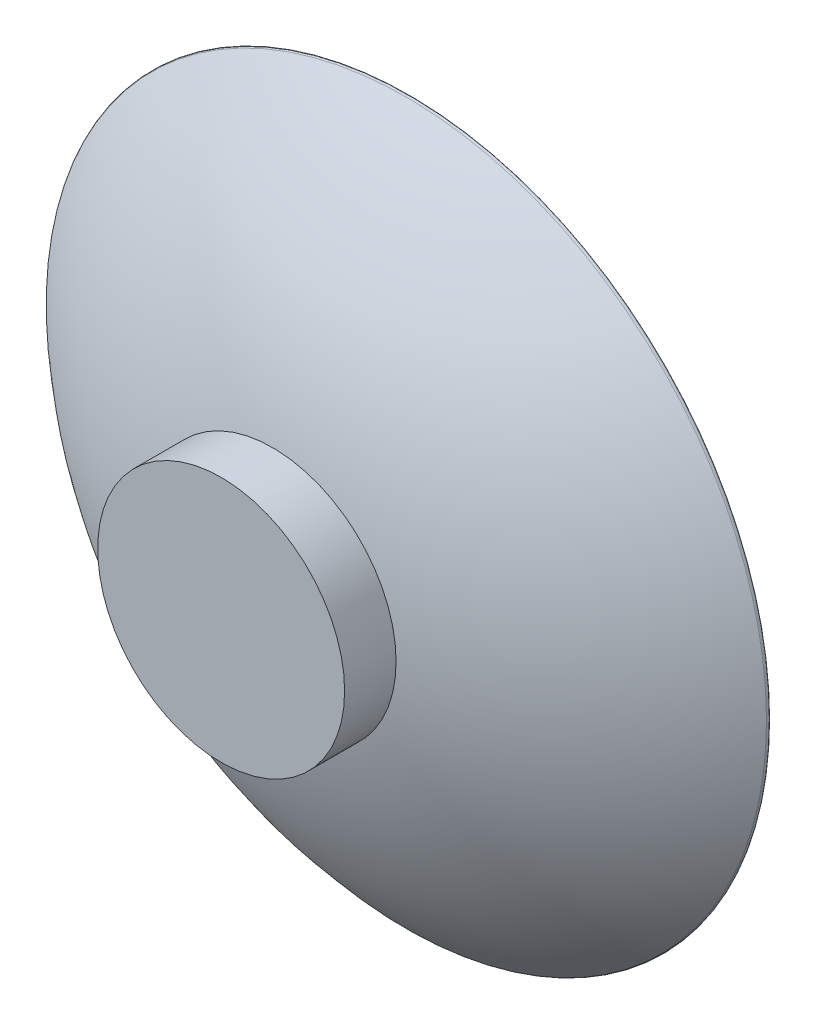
ISO-10303-21;
HEADER;
FILE_DESCRIPTION(('STEP AP214'),'2;1');
FILE_NAME('part.step','',(''),(''),'','','');
FILE_SCHEMA(('AUTOMOTIVE_DESIGN { 1 0 10303 214 1 1 1 1 }'));
ENDSEC;
DATA;
#1=APPLICATION_CONTEXT('core data for automotive mechanical design processes');
#2=APPLICATION_PROTOCOL_DEFINITION('international standard','automotive_design',2000,#1);
#3=PRODUCT_CONTEXT('',#1,'mechanical');
#4=PRODUCT('Part','Part','',(#3));
#5=PRODUCT_RELATED_PRODUCT_CATEGORY('part','',(#4));
#6=PRODUCT_DEFINITION_FORMATION('','',#4);
#7=PRODUCT_DEFINITION_CONTEXT('part definition',#1,'design');
#8=PRODUCT_DEFINITION('design','',#6,#7);
#9=PRODUCT_DEFINITION_SHAPE('','',#8);
#10=(LENGTH_UNIT() NAMED_UNIT(*) SI_UNIT(.MILLI.,.METRE.));
#11=(NAMED_UNIT(*) PLANE_ANGLE_UNIT() SI_UNIT($,.RADIAN.));
#12=(NAMED_UNIT(*) SI_UNIT($,.STERADIAN.) SOLID_ANGLE_UNIT());
#13=UNCERTAINTY_MEASURE_WITH_UNIT(LENGTH_MEASURE(1.E-05),#10,'distance_accuracy_value','');
#14=(GEOMETRIC_REPRESENTATION_CONTEXT(3) GLOBAL_UNCERTAINTY_ASSIGNED_CONTEXT((#13)) GLOBAL_UNIT_ASSIGNED_CONTEXT((#10,
#11,#12)) REPRESENTATION_CONTEXT('',''));
#15=CARTESIAN_POINT('',(0.,0.,0.));
#16=DIRECTION('',(0.,0.,1.));
#17=DIRECTION('',(1.,0.,0.));
#18=AXIS2_PLACEMENT_3D('',#15,#16,#17);
#19=CARTESIAN_POINT('',(0.921174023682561,0.,-41.5809539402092));
#20=DIRECTION('',(0.,-1.,0.));
#21=DIRECTION('',(1.,0.,0.));
#22=AXIS2_PLACEMENT_3D('',#19,#20,#21);
#23=CIRCLE('',#22,40.0106056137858);
#24=TRIMMED_CURVE('',#23,(PARAMETER_VALUE(-1.59382160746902)),
(PARAMETER_VALUE(1.59382160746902)),.T.,.PARAMETER.);
#25=CARTESIAN_POINT('',(0.,0.,-41.5809539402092));
#26=DIRECTION('',(0.,0.,1.));
#27=AXIS1_PLACEMENT('',#25,#26);
#28=SURFACE_OF_REVOLUTION('',#24,#27);
#29=CARTESIAN_POINT('',(0.,0.,-1.58095394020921));
#30=VERTEX_POINT('',#29);
#31=VERTEX_LOOP('',#30);
#32=FACE_BOUND('',#31,.T.);
#33=CARTESIAN_POINT('',(0.,0.,-81.5809539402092));
#34=VERTEX_POINT('',#33);
#35=VERTEX_LOOP('',#34);
#36=FACE_BOUND('',#35,.T.);
#37=ADVANCED_FACE('F39',(#32,#36),#28,.T.);
#38=CLOSED_SHELL('',(#37));
#39=MANIFOLD_SOLID_BREP('B2',#38);
#40=CARTESIAN_POINT('',(0.,0.,25.));
#41=DIRECTION('',(0.,0.,-1.));
#42=DIRECTION('',(-1.,0.,0.));
#43=AXIS2_PLACEMENT_3D('',#40,#41,#42);
#44=CYLINDRICAL_SURFACE('',#43,60.);
#45=CARTESIAN_POINT('',(0.,0.,25.));
#46=DIRECTION('',(0.,0.,1.));
#47=DIRECTION('',(1.,0.,0.));
#48=AXIS2_PLACEMENT_3D('',#45,#46,#47);
#49=CIRCLE('',#48,60.);
#50=CARTESIAN_POINT('',(60.,0.,25.));
#51=VERTEX_POINT('',#50);
#52=EDGE_CURVE('E64',#51,#51,#49,.T.);
#53=ORIENTED_EDGE('',*,*,#52,.F.);
#54=EDGE_LOOP('',(#53));
#55=FACE_BOUND('',#54,.T.);
#56=CARTESIAN_POINT('',(0.,0.,0.));
#57=DIRECTION('',(0.,0.,1.));
#58=DIRECTION('',(1.,0.,0.));
#59=AXIS2_PLACEMENT_3D('',#56,#57,#58);
#60=CIRCLE('',#59,60.);
#61=CARTESIAN_POINT('',(60.,0.,0.));
#62=VERTEX_POINT('',#61);
#63=EDGE_CURVE('E68',#62,#62,#60,.T.);
#64=ORIENTED_EDGE('',*,*,#63,.T.);
#65=EDGE_LOOP('',(#64));
#66=FACE_BOUND('',#65,.T.);
#67=ADVANCED_FACE('F58',(#55,#66),#44,.T.);
#68=CARTESIAN_POINT('',(0.,0.,25.));
#69=DIRECTION('',(0.,0.,1.));
#70=DIRECTION('',(1.,0.,0.));
#71=AXIS2_PLACEMENT_3D('',#68,#69,#70);
#72=PLANE('',#71);
#73=ORIENTED_EDGE('',*,*,#52,.T.);
#74=EDGE_LOOP('',(#73));
#75=FACE_BOUND('',#74,.T.);
#76=ADVANCED_FACE('F351',(#75),#72,.T.);
#77=CARTESIAN_POINT('',(0.,0.,0.));
#78=DIRECTION('',(0.,0.,1.));
#79=DIRECTION('',(1.,0.,0.));
#80=AXIS2_PLACEMENT_3D('',#77,#78,#79);
#81=PLANE('',#80);
#82=CARTESIAN_POINT('',(0.,0.,0.));
#83=DIRECTION('',(0.,0.,1.));
#84=DIRECTION('',(1.,0.,0.));
#85=AXIS2_PLACEMENT_3D('',#82,#83,#84);
#86=CIRCLE('',#85,13.4962389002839);
#87=CARTESIAN_POINT('',(13.4962389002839,0.,0.));
#88=VERTEX_POINT('',#87);
#89=EDGE_CURVE('E38',#88,#88,#86,.F.);
#90=ORIENTED_EDGE('',*,*,#89,.F.);
#91=EDGE_LOOP('',(#90));
#92=FACE_BOUND('',#91,.T.);
#93=ORIENTED_EDGE('',*,*,#63,.F.);
#94=EDGE_LOOP('',(#93));
#95=FACE_BOUND('',#94,.T.);
#96=ADVANCED_FACE('F356',(#92,#95),#81,.F.);
#97=CARTESIAN_POINT('',(0.,0.,-249.908909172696));
#98=DIRECTION('',(0.,0.,1.));
#99=DIRECTION('',(1.,0.,0.));
#100=AXIS2_PLACEMENT_3D('',#97,#98,#99);
#101=DEGENERATE_TOROIDAL_SURFACE('',#100,6.74811945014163,250.,.T.);
#102=CARTESIAN_POINT('',(0.,0.,-65.));
#103=DIRECTION('',(0.,0.,1.));
#104=DIRECTION('',(1.,0.,0.));
#105=AXIS2_PLACEMENT_3D('',#102,#103,#104);
#106=CIRCLE('',#105,175.);
#107=CARTESIAN_POINT('',(175.,0.,-65.));
#108=VERTEX_POINT('',#107);
#109=EDGE_CURVE('E73',#108,#108,#106,.T.);
#110=ORIENTED_EDGE('',*,*,#109,.T.);
#111=EDGE_LOOP('',(#110));
#112=FACE_BOUND('',#111,.T.);
#113=ORIENTED_EDGE('',*,*,#89,.T.);
#114=EDGE_LOOP('',(#113));
#115=FACE_BOUND('',#114,.T.);
#116=ADVANCED_FACE('F362',(#112,#115),#101,.T.);
#117=CARTESIAN_POINT('',(0.,0.,-65.7396356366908));
#118=DIRECTION('',(0.,0.,1.));
#119=DIRECTION('',(1.,0.,0.));
#120=AXIS2_PLACEMENT_3D('',#117,#118,#119);
#121=TOROIDAL_SURFACE('',#120,174.326992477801,1.00000000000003);
#122=ORIENTED_EDGE('',*,*,#109,.F.);
#123=EDGE_LOOP('',(#122));
#124=FACE_BOUND('',#123,.T.);
#125=CARTESIAN_POINT('',(0.,0.,-66.4792712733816));
#126=DIRECTION('',(0.,0.,1.));
#127=DIRECTION('',(1.,0.,0.));
#128=AXIS2_PLACEMENT_3D('',#125,#126,#127);
#129=CIRCLE('',#128,173.653984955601);
#130=CARTESIAN_POINT('',(173.653984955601,0.,-66.4792712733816));
#131=VERTEX_POINT('',#130);
#132=EDGE_CURVE('E77',#131,#131,#129,.T.);
#133=ORIENTED_EDGE('',*,*,#132,.T.);
#134=EDGE_LOOP('',(#133));
#135=FACE_BOUND('',#134,.T.);
#136=ADVANCED_FACE('F367',(#124,#135),#121,.T.);
#137=CARTESIAN_POINT('',(0.,0.,-65.1469262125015));
#138=DIRECTION('',(0.,0.,1.));
#139=DIRECTION('',(1.,0.,0.));
#140=AXIS2_PLACEMENT_3D('',#137,#138,#139);
#141=TOROIDAL_SURFACE('',#140,172.162389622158,2.00000000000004);
#142=ORIENTED_EDGE('',*,*,#132,.F.);
#143=EDGE_LOOP('',(#142));
#144=FACE_BOUND('',#143,.T.);
#145=CARTESIAN_POINT('',(0.,0.,-63.8111896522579));
#146=DIRECTION('',(0.,0.,1.));
#147=DIRECTION('',(1.,0.,0.));
#148=AXIS2_PLACEMENT_3D('',#145,#146,#147);
#149=CIRCLE('',#148,170.673830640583);
#150=CARTESIAN_POINT('',(170.673830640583,0.,-63.8111896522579));
#151=VERTEX_POINT('',#150);
#152=EDGE_CURVE('E80',#151,#151,#149,.T.);
#153=ORIENTED_EDGE('',*,*,#152,.T.);
#154=EDGE_LOOP('',(#153));
#155=FACE_BOUND('',#154,.T.);
#156=ADVANCED_FACE('F373',(#144,#155),#141,.T.);
#157=CARTESIAN_POINT('',(0.,0.,-249.908909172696));
#158=DIRECTION('',(0.,0.,1.));
#159=DIRECTION('',(1.,0.,0.));
#160=AXIS2_PLACEMENT_3D('',#157,#158,#159);
#161=DEGENERATE_TOROIDAL_SURFACE('',#160,6.74811945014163,247.999999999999,.T.);
#162=ORIENTED_EDGE('',*,*,#152,.F.);
#163=EDGE_LOOP('',(#162));
#164=FACE_BOUND('',#163,.T.);
#165=CARTESIAN_POINT('',(0.,0.,-63.6623332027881));
#166=DIRECTION('',(0.,0.,1.));
#167=DIRECTION('',(1.,0.,0.));
#168=AXIS2_PLACEMENT_3D('',#165,#166,#167);
#169=CIRCLE('',#168,170.504685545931);
#170=CARTESIAN_POINT('',(170.504685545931,0.,-63.6623332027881));
#171=VERTEX_POINT('',#170);
#172=EDGE_CURVE('E83',#171,#171,#169,.T.);
#173=ORIENTED_EDGE('',*,*,#172,.T.);
#174=EDGE_LOOP('',(#173));
#175=FACE_BOUND('',#174,.T.);
#176=ADVANCED_FACE('F377',(#164,#175),#161,.F.);
#177=CARTESIAN_POINT('',(0.,0.,-62.3555936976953));
#178=DIRECTION('',(0.,0.,1.));
#179=DIRECTION('',(1.,0.,0.));
#180=AXIS2_PLACEMENT_3D('',#177,#178,#179);
#181=TOROIDAL_SURFACE('',#180,168.99060765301,2.00000000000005);
#182=ORIENTED_EDGE('',*,*,#172,.F.);
#183=EDGE_LOOP('',(#182));
#184=FACE_BOUND('',#183,.T.);
#185=CARTESIAN_POINT('',(0.,0.,-61.0454114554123));
#186=DIRECTION('',(0.,0.,1.));
#187=DIRECTION('',(1.,0.,0.));
#188=AXIS2_PLACEMENT_3D('',#185,#186,#187);
#189=CIRCLE('',#188,167.479507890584);
#190=CARTESIAN_POINT('',(167.479507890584,0.,-61.0454114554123));
#191=VERTEX_POINT('',#190);
#192=EDGE_CURVE('E86',#191,#191,#189,.T.);
#193=ORIENTED_EDGE('',*,*,#192,.T.);
#194=EDGE_LOOP('',(#193));
#195=FACE_BOUND('',#194,.T.);
#196=ADVANCED_FACE('F381',(#184,#195),#181,.T.);
#197=CARTESIAN_POINT('',(0.,0.,-249.908909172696));
#198=DIRECTION('',(0.,0.,1.));
#199=DIRECTION('',(1.,0.,0.));
#200=AXIS2_PLACEMENT_3D('',#197,#198,#199);
#201=DEGENERATE_TOROIDAL_SURFACE('',#200,6.74811945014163,247.999999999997,.T.);
#202=ORIENTED_EDGE('',*,*,#192,.F.);
#203=EDGE_LOOP('',(#202));
#204=FACE_BOUND('',#203,.T.);
#205=CARTESIAN_POINT('',(0.,0.,-60.8994583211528));
#206=DIRECTION('',(0.,0.,1.));
#207=DIRECTION('',(1.,0.,0.));
#208=AXIS2_PLACEMENT_3D('',#205,#206,#207);
#209=CIRCLE('',#208,167.307851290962);
#210=CARTESIAN_POINT('',(167.307851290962,0.,-60.8994583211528));
#211=VERTEX_POINT('',#210);
#212=EDGE_CURVE('E89',#211,#211,#209,.T.);
#213=ORIENTED_EDGE('',*,*,#212,.T.);
#214=EDGE_LOOP('',(#213));
#215=FACE_BOUND('',#214,.T.);
#216=ADVANCED_FACE('F385',(#204,#215),#201,.F.);
#217=CARTESIAN_POINT('',(0.,0.,-59.6187036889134));
#218=DIRECTION('',(0.,0.,1.));
#219=DIRECTION('',(1.,0.,0.));
#220=AXIS2_PLACEMENT_3D('',#217,#218,#219);
#221=TOROIDAL_SURFACE('',#220,165.771730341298,2.00000000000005);
#222=ORIENTED_EDGE('',*,*,#212,.F.);
#223=EDGE_LOOP('',(#222));
#224=FACE_BOUND('',#223,.T.);
#225=CARTESIAN_POINT('',(0.,0.,-58.334456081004));
#226=DIRECTION('',(0.,0.,1.));
#227=DIRECTION('',(1.,0.,0.));
#228=AXIS2_PLACEMENT_3D('',#225,#226,#227);
#229=CIRCLE('',#228,164.238528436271);
#230=CARTESIAN_POINT('',(164.238528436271,0.,-58.334456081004));
#231=VERTEX_POINT('',#230);
#232=EDGE_CURVE('E92',#231,#231,#229,.T.);
#233=ORIENTED_EDGE('',*,*,#232,.T.);
#234=EDGE_LOOP('',(#233));
#235=FACE_BOUND('',#234,.T.);
#236=ADVANCED_FACE('F389',(#224,#235),#221,.T.);
#237=CARTESIAN_POINT('',(0.,0.,-249.908909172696));
#238=DIRECTION('',(0.,0.,1.));
#239=DIRECTION('',(1.,0.,0.));
#240=AXIS2_PLACEMENT_3D('',#237,#238,#239);
#241=DEGENERATE_TOROIDAL_SURFACE('',#240,6.74811945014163,247.999999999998,.T.);
#242=ORIENTED_EDGE('',*,*,#232,.F.);
#243=EDGE_LOOP('',(#242));
#244=FACE_BOUND('',#243,.T.);
#245=CARTESIAN_POINT('',(0.,0.,-58.1914486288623));
#246=DIRECTION('',(0.,0.,1.));
#247=DIRECTION('',(1.,0.,0.));
#248=AXIS2_PLACEMENT_3D('',#245,#246,#247);
#249=CIRCLE('',#248,164.06441015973);
#250=CARTESIAN_POINT('',(164.06441015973,0.,-58.1914486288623));
#251=VERTEX_POINT('',#250);
#252=EDGE_CURVE('E95',#251,#251,#249,.T.);
#253=ORIENTED_EDGE('',*,*,#252,.T.);
#254=EDGE_LOOP('',(#253));
#255=FACE_BOUND('',#254,.T.);
#256=ADVANCED_FACE('F393',(#244,#255),#241,.F.);
#257=CARTESIAN_POINT('',(0.,0.,-56.9370506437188));
#258=DIRECTION('',(0.,0.,1.));
#259=DIRECTION('',(1.,0.,0.));
#260=AXIS2_PLACEMENT_3D('',#257,#258,#259);
#261=TOROIDAL_SURFACE('',#260,162.506692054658,2.);
#262=ORIENTED_EDGE('',*,*,#252,.F.);
#263=EDGE_LOOP('',(#262));
#264=FACE_BOUND('',#263,.T.);
#265=CARTESIAN_POINT('',(0.,0.,-55.6791104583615));
#266=DIRECTION('',(0.,0.,1.));
#267=DIRECTION('',(1.,0.,0.));
#268=AXIS2_PLACEMENT_3D('',#265,#266,#267);
#269=CIRCLE('',#268,160.951833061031);
#270=CARTESIAN_POINT('',(160.951833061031,0.,-55.6791104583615));
#271=VERTEX_POINT('',#270);
#272=EDGE_CURVE('E98',#271,#271,#269,.T.);
#273=ORIENTED_EDGE('',*,*,#272,.T.);
#274=EDGE_LOOP('',(#273));
#275=FACE_BOUND('',#274,.T.);
#276=ADVANCED_FACE('F397',(#264,#275),#261,.T.);
#277=CARTESIAN_POINT('',(0.,0.,-249.908909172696));
#278=DIRECTION('',(0.,0.,1.));
#279=DIRECTION('',(1.,0.,0.));
#280=AXIS2_PLACEMENT_3D('',#277,#278,#279);
#281=DEGENERATE_TOROIDAL_SURFACE('',#280,6.74811945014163,248.,.T.);
#282=ORIENTED_EDGE('',*,*,#272,.F.);
#283=EDGE_LOOP('',(#282));
#284=FACE_BOUND('',#283,.T.);
#285=CARTESIAN_POINT('',(0.,0.,-55.5390902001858));
#286=DIRECTION('',(0.,0.,1.));
#287=DIRECTION('',(1.,0.,0.));
#288=AXIS2_PLACEMENT_3D('',#285,#286,#287);
#289=CIRCLE('',#288,160.775303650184);
#290=CARTESIAN_POINT('',(160.775303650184,0.,-55.5390902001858));
#291=VERTEX_POINT('',#290);
#292=EDGE_CURVE('E101',#291,#291,#289,.T.);
#293=ORIENTED_EDGE('',*,*,#292,.T.);
#294=EDGE_LOOP('',(#293));
#295=FACE_BOUND('',#294,.T.);
#296=ADVANCED_FACE('F401',(#284,#295),#281,.F.);
#297=CARTESIAN_POINT('',(0.,0.,-54.3114129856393));
#298=DIRECTION('',(0.,0.,1.));
#299=DIRECTION('',(1.,0.,0.));
#300=AXIS2_PLACEMENT_3D('',#297,#298,#299);
#301=TOROIDAL_SURFACE('',#300,159.19644056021,1.99999999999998);
#302=ORIENTED_EDGE('',*,*,#292,.F.);
#303=EDGE_LOOP('',(#302));
#304=FACE_BOUND('',#303,.T.);
#305=CARTESIAN_POINT('',(0.,0.,-53.0801453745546));
#306=DIRECTION('',(0.,0.,1.));
#307=DIRECTION('',(1.,0.,0.));
#308=AXIS2_PLACEMENT_3D('',#305,#306,#307);
#309=CIRCLE('',#308,157.620375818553);
#310=CARTESIAN_POINT('',(157.620375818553,0.,-53.0801453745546));
#311=VERTEX_POINT('',#310);
#312=EDGE_CURVE('E104',#311,#311,#309,.T.);
#313=ORIENTED_EDGE('',*,*,#312,.T.);
#314=EDGE_LOOP('',(#313));
#315=FACE_BOUND('',#314,.T.);
#316=ADVANCED_FACE('F405',(#304,#315),#301,.T.);
#317=CARTESIAN_POINT('',(0.,0.,-249.908909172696));
#318=DIRECTION('',(0.,0.,1.));
#319=DIRECTION('',(1.,0.,0.));
#320=AXIS2_PLACEMENT_3D('',#317,#318,#319);
#321=DEGENERATE_TOROIDAL_SURFACE('',#320,6.74811945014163,248.,.T.);
#322=ORIENTED_EDGE('',*,*,#312,.F.);
#323=EDGE_LOOP('',(#322));
#324=FACE_BOUND('',#323,.T.);
#325=CARTESIAN_POINT('',(0.,0.,-52.9431529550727));
#326=DIRECTION('',(0.,0.,1.));
#327=DIRECTION('',(1.,0.,0.));
#328=AXIS2_PLACEMENT_3D('',#325,#326,#327);
#329=CIRCLE('',#328,157.441486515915);
#330=CARTESIAN_POINT('',(157.441486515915,0.,-52.9431529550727));
#331=VERTEX_POINT('',#330);
#332=EDGE_CURVE('E107',#331,#331,#329,.T.);
#333=ORIENTED_EDGE('',*,*,#332,.T.);
#334=EDGE_LOOP('',(#333));
#335=FACE_BOUND('',#334,.T.);
#336=ADVANCED_FACE('F409',(#324,#335),#321,.F.);
#337=CARTESIAN_POINT('',(0.,0.,-51.7425528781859));
#338=DIRECTION('',(0.,0.,1.));
#339=DIRECTION('',(1.,0.,0.));
#340=AXIS2_PLACEMENT_3D('',#337,#338,#339);
#341=TOROIDAL_SURFACE('',#340,155.841936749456,2.00000000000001);
#342=ORIENTED_EDGE('',*,*,#332,.F.);
#343=EDGE_LOOP('',(#342));
#344=FACE_BOUND('',#343,.T.);
#345=CARTESIAN_POINT('',(0.,0.,-50.5383152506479));
#346=DIRECTION('',(0.,0.,1.));
#347=DIRECTION('',(1.,0.,0.));
#348=AXIS2_PLACEMENT_3D('',#345,#346,#347);
#349=CIRCLE('',#348,154.24512375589);
#350=CARTESIAN_POINT('',(154.24512375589,0.,-50.5383152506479));
#351=VERTEX_POINT('',#350);
#352=EDGE_CURVE('E110',#351,#351,#349,.T.);
#353=ORIENTED_EDGE('',*,*,#352,.T.);
#354=EDGE_LOOP('',(#353));
#355=FACE_BOUND('',#354,.T.);
#356=ADVANCED_FACE('F413',(#344,#355),#341,.T.);
#357=CARTESIAN_POINT('',(0.,0.,-249.908909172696));
#358=DIRECTION('',(0.,0.,1.));
#359=DIRECTION('',(1.,0.,0.));
#360=AXIS2_PLACEMENT_3D('',#357,#358,#359);
#361=DEGENERATE_TOROIDAL_SURFACE('',#360,6.74811945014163,248.,.T.);
#362=ORIENTED_EDGE('',*,*,#352,.F.);
#363=EDGE_LOOP('',(#362));
#364=FACE_BOUND('',#363,.T.);
#365=CARTESIAN_POINT('',(0.,0.,-50.4043904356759));
#366=DIRECTION('',(0.,0.,1.));
#367=DIRECTION('',(1.,0.,0.));
#368=AXIS2_PLACEMENT_3D('',#365,#366,#367);
#369=CIRCLE('',#368,154.063926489);
#370=CARTESIAN_POINT('',(154.063926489,0.,-50.4043904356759));
#371=VERTEX_POINT('',#370);
#372=EDGE_CURVE('E113',#371,#371,#369,.T.);
#373=ORIENTED_EDGE('',*,*,#372,.T.);
#374=EDGE_LOOP('',(#373));
#375=FACE_BOUND('',#374,.T.);
#376=ADVANCED_FACE('F417',(#364,#375),#361,.F.);
#377=CARTESIAN_POINT('',(0.,0.,-49.2312160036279));
#378=DIRECTION('',(0.,0.,1.));
#379=DIRECTION('',(1.,0.,0.));
#380=AXIS2_PLACEMENT_3D('',#377,#378,#379);
#381=TOROIDAL_SURFACE('',#380,152.444154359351,1.99999999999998);
#382=ORIENTED_EDGE('',*,*,#372,.F.);
#383=EDGE_LOOP('',(#382));
#384=FACE_BOUND('',#383,.T.);
#385=CARTESIAN_POINT('',(0.,0.,-48.0543579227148));
#386=DIRECTION('',(0.,0.,1.));
#387=DIRECTION('',(1.,0.,0.));
#388=AXIS2_PLACEMENT_3D('',#385,#386,#387);
#389=CIRCLE('',#388,150.827056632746);
#390=CARTESIAN_POINT('',(150.827056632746,0.,-48.0543579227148));
#391=VERTEX_POINT('',#390);
#392=EDGE_CURVE('E116',#391,#391,#389,.T.);
#393=ORIENTED_EDGE('',*,*,#392,.T.);
#394=EDGE_LOOP('',(#393));
#395=FACE_BOUND('',#394,.T.);
#396=ADVANCED_FACE('F421',(#384,#395),#381,.T.);
#397=CARTESIAN_POINT('',(0.,0.,-249.908909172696));
#398=DIRECTION('',(0.,0.,1.));
#399=DIRECTION('',(1.,0.,0.));
#400=AXIS2_PLACEMENT_3D('',#397,#398,#399);
#401=DEGENERATE_TOROIDAL_SURFACE('',#400,6.74811945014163,248.,.T.);
#402=ORIENTED_EDGE('',*,*,#392,.F.);
#403=EDGE_LOOP('',(#402));
#404=FACE_BOUND('',#403,.T.);
#405=CARTESIAN_POINT('',(0.,0.,-47.9235395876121));
#406=DIRECTION('',(0.,0.,1.));
#407=DIRECTION('',(1.,0.,0.));
#408=AXIS2_PLACEMENT_3D('',#405,#406,#407);
#409=CIRCLE('',#408,150.643603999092);
#410=CARTESIAN_POINT('',(150.643603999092,0.,-47.9235395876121));
#411=VERTEX_POINT('',#410);
#412=EDGE_CURVE('E119',#411,#411,#409,.T.);
#413=ORIENTED_EDGE('',*,*,#412,.T.);
#414=EDGE_LOOP('',(#413));
#415=FACE_BOUND('',#414,.T.);
#416=ADVANCED_FACE('F425',(#404,#415),#401,.F.);
#417=CARTESIAN_POINT('',(0.,0.,-46.7781313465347));
#418=DIRECTION('',(0.,0.,1.));
#419=DIRECTION('',(1.,0.,0.));
#420=AXIS2_PLACEMENT_3D('',#417,#418,#419);
#421=TOROIDAL_SURFACE('',#420,149.004079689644,1.99999999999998);
#422=ORIENTED_EDGE('',*,*,#412,.F.);
#423=EDGE_LOOP('',(#422));
#424=FACE_BOUND('',#423,.T.);
#425=CARTESIAN_POINT('',(0.,0.,-45.6289944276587));
#426=DIRECTION('',(0.,0.,1.));
#427=DIRECTION('',(1.,0.,0.));
#428=AXIS2_PLACEMENT_3D('',#425,#426,#427);
#429=CIRCLE('',#428,147.367166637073);
#430=CARTESIAN_POINT('',(147.367166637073,0.,-45.6289944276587));
#431=VERTEX_POINT('',#430);
#432=EDGE_CURVE('E122',#431,#431,#429,.T.);
#433=ORIENTED_EDGE('',*,*,#432,.T.);
#434=EDGE_LOOP('',(#433));
#435=FACE_BOUND('',#434,.T.);
#436=ADVANCED_FACE('F429',(#424,#435),#421,.T.);
#437=CARTESIAN_POINT('',(0.,0.,-249.908909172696));
#438=DIRECTION('',(0.,0.,1.));
#439=DIRECTION('',(1.,0.,0.));
#440=AXIS2_PLACEMENT_3D('',#437,#438,#439);
#441=DEGENERATE_TOROIDAL_SURFACE('',#440,6.74811945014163,248.,.T.);
#442=ORIENTED_EDGE('',*,*,#432,.F.);
#443=EDGE_LOOP('',(#442));
#444=FACE_BOUND('',#443,.T.);
#445=CARTESIAN_POINT('',(0.,0.,-45.5013205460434));
#446=DIRECTION('',(0.,0.,1.));
#447=DIRECTION('',(1.,0.,0.));
#448=AXIS2_PLACEMENT_3D('',#445,#446,#447);
#449=CIRCLE('',#448,147.181511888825);
#450=CARTESIAN_POINT('',(147.181511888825,0.,-45.5013205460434));
#451=VERTEX_POINT('',#450);
#452=EDGE_CURVE('E125',#451,#451,#449,.T.);
#453=ORIENTED_EDGE('',*,*,#452,.T.);
#454=EDGE_LOOP('',(#453));
#455=FACE_BOUND('',#454,.T.);
#456=ADVANCED_FACE('F433',(#444,#455),#441,.F.);
#457=CARTESIAN_POINT('',(0.,0.,-44.3840109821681));
#458=DIRECTION('',(0.,0.,1.));
#459=DIRECTION('',(1.,0.,0.));
#460=AXIS2_PLACEMENT_3D('',#457,#458,#459);
#461=TOROIDAL_SURFACE('',#460,145.522711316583,1.99999999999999);
#462=ORIENTED_EDGE('',*,*,#452,.F.);
#463=EDGE_LOOP('',(#462));
#464=FACE_BOUND('',#463,.T.);
#465=CARTESIAN_POINT('',(0.,0.,-43.2629287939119));
#466=DIRECTION('',(0.,0.,1.));
#467=DIRECTION('',(1.,0.,0.));
#468=AXIS2_PLACEMENT_3D('',#465,#466,#467);
#469=CIRCLE('',#468,143.866458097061);
#470=CARTESIAN_POINT('',(143.866458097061,0.,-43.2629287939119));
#471=VERTEX_POINT('',#470);
#472=EDGE_CURVE('E128',#471,#471,#469,.T.);
#473=ORIENTED_EDGE('',*,*,#472,.T.);
#474=EDGE_LOOP('',(#473));
#475=FACE_BOUND('',#474,.T.);
#476=ADVANCED_FACE('F437',(#464,#475),#461,.T.);
#477=CARTESIAN_POINT('',(0.,0.,-249.908909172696));
#478=DIRECTION('',(0.,0.,1.));
#479=DIRECTION('',(1.,0.,0.));
#480=AXIS2_PLACEMENT_3D('',#477,#478,#479);
#481=DEGENERATE_TOROIDAL_SURFACE('',#480,6.74811945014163,248.,.T.);
#482=ORIENTED_EDGE('',*,*,#472,.F.);
#483=EDGE_LOOP('',(#482));
#484=FACE_BOUND('',#483,.T.);
#485=CARTESIAN_POINT('',(0.,0.,-43.1384364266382));
#486=DIRECTION('',(0.,0.,1.));
#487=DIRECTION('',(1.,0.,0.));
#488=AXIS2_PLACEMENT_3D('',#485,#486,#487);
#489=CIRCLE('',#488,143.678655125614);
#490=CARTESIAN_POINT('',(143.678655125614,0.,-43.1384364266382));
#491=VERTEX_POINT('',#490);
#492=EDGE_CURVE('E131',#491,#491,#489,.T.);
#493=ORIENTED_EDGE('',*,*,#492,.T.);
#494=EDGE_LOOP('',(#493));
#495=FACE_BOUND('',#494,.T.);
#496=ADVANCED_FACE('F441',(#484,#495),#481,.F.);
#497=CARTESIAN_POINT('',(0.,0.,-42.0495498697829));
#498=DIRECTION('',(0.,0.,1.));
#499=DIRECTION('',(1.,0.,0.));
#500=AXIS2_PLACEMENT_3D('',#497,#498,#499);
#501=TOROIDAL_SURFACE('',#500,142.001059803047,1.99999999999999);
#502=ORIENTED_EDGE('',*,*,#492,.F.);
#503=EDGE_LOOP('',(#502));
#504=FACE_BOUND('',#503,.T.);
#505=CARTESIAN_POINT('',(0.,0.,-40.9568478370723));
#506=DIRECTION('',(0.,0.,1.));
#507=DIRECTION('',(1.,0.,0.));
#508=AXIS2_PLACEMENT_3D('',#505,#506,#507);
#509=CIRCLE('',#508,140.325947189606);
#510=CARTESIAN_POINT('',(140.325947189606,0.,-40.9568478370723));
#511=VERTEX_POINT('',#510);
#512=EDGE_CURVE('E134',#511,#511,#509,.T.);
#513=ORIENTED_EDGE('',*,*,#512,.T.);
#514=EDGE_LOOP('',(#513));
#515=FACE_BOUND('',#514,.T.);
#516=ADVANCED_FACE('F445',(#504,#515),#501,.T.);
#517=CARTESIAN_POINT('',(0.,0.,-249.908909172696));
#518=DIRECTION('',(0.,0.,1.));
#519=DIRECTION('',(1.,0.,0.));
#520=AXIS2_PLACEMENT_3D('',#517,#518,#519);
#521=DEGENERATE_TOROIDAL_SURFACE('',#520,6.74811945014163,248.,.T.);
#522=ORIENTED_EDGE('',*,*,#512,.F.);
#523=EDGE_LOOP('',(#522));
#524=FACE_BOUND('',#523,.T.);
#525=CARTESIAN_POINT('',(0.,0.,-40.8355731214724));
#526=DIRECTION('',(0.,0.,1.));
#527=DIRECTION('',(1.,0.,0.));
#528=AXIS2_PLACEMENT_3D('',#525,#526,#527);
#529=CIRCLE('',#528,140.136050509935);
#530=CARTESIAN_POINT('',(140.136050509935,0.,-40.8355731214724));
#531=VERTEX_POINT('',#530);
#532=EDGE_CURVE('E137',#531,#531,#529,.T.);
#533=ORIENTED_EDGE('',*,*,#532,.T.);
#534=EDGE_LOOP('',(#533));
#535=FACE_BOUND('',#534,.T.);
#536=ADVANCED_FACE('F449',(#524,#535),#521,.F.);
#537=CARTESIAN_POINT('',(0.,0.,-39.7754256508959));
#538=DIRECTION('',(0.,0.,1.));
#539=DIRECTION('',(1.,0.,0.));
#540=AXIS2_PLACEMENT_3D('',#537,#538,#539);
#541=TOROIDAL_SURFACE('',#540,138.440147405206,1.99999999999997);
#542=ORIENTED_EDGE('',*,*,#532,.F.);
#543=EDGE_LOOP('',(#542));
#544=FACE_BOUND('',#543,.T.);
#545=CARTESIAN_POINT('',(0.,0.,-38.7114209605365));
#546=DIRECTION('',(0.,0.,1.));
#547=DIRECTION('',(1.,0.,0.));
#548=AXIS2_PLACEMENT_3D('',#545,#546,#547);
#549=CIRCLE('',#548,136.746661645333);
#550=CARTESIAN_POINT('',(136.746661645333,0.,-38.7114209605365));
#551=VERTEX_POINT('',#550);
#552=EDGE_CURVE('E140',#551,#551,#549,.T.);
#553=ORIENTED_EDGE('',*,*,#552,.T.);
#554=EDGE_LOOP('',(#553));
#555=FACE_BOUND('',#554,.T.);
#556=ADVANCED_FACE('F453',(#544,#555),#541,.T.);
#557=CARTESIAN_POINT('',(0.,0.,-249.908909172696));
#558=DIRECTION('',(0.,0.,1.));
#559=DIRECTION('',(1.,0.,0.));
#560=AXIS2_PLACEMENT_3D('',#557,#558,#559);
#561=DEGENERATE_TOROIDAL_SURFACE('',#560,6.74811945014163,248.,.T.);
#562=ORIENTED_EDGE('',*,*,#552,.F.);
#563=EDGE_LOOP('',(#562));
#564=FACE_BOUND('',#563,.T.);
#565=CARTESIAN_POINT('',(0.,0.,-38.5933990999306));
#566=DIRECTION('',(0.,0.,1.));
#567=DIRECTION('',(1.,0.,0.));
#568=AXIS2_PLACEMENT_3D('',#565,#566,#567);
#569=CIRCLE('',#568,136.554726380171);
#570=CARTESIAN_POINT('',(136.554726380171,0.,-38.5933990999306));
#571=VERTEX_POINT('',#570);
#572=EDGE_CURVE('E143',#571,#571,#569,.T.);
#573=ORIENTED_EDGE('',*,*,#572,.T.);
#574=EDGE_LOOP('',(#573));
#575=FACE_BOUND('',#574,.T.);
#576=ADVANCED_FACE('F457',(#564,#575),#561,.F.);
#577=CARTESIAN_POINT('',(0.,0.,-37.5622984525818));
#578=DIRECTION('',(0.,0.,1.));
#579=DIRECTION('',(1.,0.,0.));
#580=AXIS2_PLACEMENT_3D('',#577,#578,#579);
#581=TOROIDAL_SURFACE('',#580,134.84100777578,1.99999999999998);
#582=ORIENTED_EDGE('',*,*,#572,.F.);
#583=EDGE_LOOP('',(#582));
#584=FACE_BOUND('',#583,.T.);
#585=CARTESIAN_POINT('',(0.,0.,-36.5272999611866));
#586=DIRECTION('',(0.,0.,1.));
#587=DIRECTION('',(1.,0.,0.));
#588=AXIS2_PLACEMENT_3D('',#585,#586,#587);
#589=CIRCLE('',#588,133.129640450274);
#590=CARTESIAN_POINT('',(133.129640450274,0.,-36.5272999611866));
#591=VERTEX_POINT('',#590);
#592=EDGE_CURVE('E146',#591,#591,#589,.T.);
#593=ORIENTED_EDGE('',*,*,#592,.T.);
#594=EDGE_LOOP('',(#593));
#595=FACE_BOUND('',#594,.T.);
#596=ADVANCED_FACE('F461',(#584,#595),#581,.T.);
#597=CARTESIAN_POINT('',(0.,0.,-249.908909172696));
#598=DIRECTION('',(0.,0.,1.));
#599=DIRECTION('',(1.,0.,0.));
#600=AXIS2_PLACEMENT_3D('',#597,#598,#599);
#601=DEGENERATE_TOROIDAL_SURFACE('',#600,6.74811945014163,248.,.T.);
#602=ORIENTED_EDGE('',*,*,#592,.F.);
#603=EDGE_LOOP('',(#602));
#604=FACE_BOUND('',#603,.T.);
#605=CARTESIAN_POINT('',(0.,0.,-36.4125652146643));
#606=DIRECTION('',(0.,0.,1.));
#607=DIRECTION('',(1.,0.,0.));
#608=AXIS2_PLACEMENT_3D('',#605,#606,#607);
#609=CIRCLE('',#608,132.935722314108);
#610=CARTESIAN_POINT('',(132.935722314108,0.,-36.4125652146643));
#611=VERTEX_POINT('',#610);
#612=EDGE_CURVE('E149',#611,#611,#609,.T.);
#613=ORIENTED_EDGE('',*,*,#612,.T.);
#614=EDGE_LOOP('',(#613));
#615=FACE_BOUND('',#614,.T.);
#616=ADVANCED_FACE('F465',(#604,#615),#601,.F.);
#617=CARTESIAN_POINT('',(0.,0.,-35.410810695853));
#618=DIRECTION('',(0.,0.,1.));
#619=DIRECTION('',(1.,0.,0.));
#620=AXIS2_PLACEMENT_3D('',#617,#618,#619);
#621=TOROIDAL_SURFACE('',#620,131.204685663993,2.00000000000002);
#622=ORIENTED_EDGE('',*,*,#612,.F.);
#623=EDGE_LOOP('',(#622));
#624=FACE_BOUND('',#623,.T.);
#625=CARTESIAN_POINT('',(0.,0.,-34.4051188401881));
#626=DIRECTION('',(0.,0.,1.));
#627=DIRECTION('',(1.,0.,0.));
#628=AXIS2_PLACEMENT_3D('',#625,#626,#627);
#629=CIRCLE('',#628,129.475933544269);
#630=CARTESIAN_POINT('',(129.475933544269,0.,-34.4051188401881));
#631=VERTEX_POINT('',#630);
#632=EDGE_CURVE('E152',#631,#631,#629,.T.);
#633=ORIENTED_EDGE('',*,*,#632,.T.);
#634=EDGE_LOOP('',(#633));
#635=FACE_BOUND('',#634,.T.);
#636=ADVANCED_FACE('F469',(#624,#635),#621,.T.);
#637=CARTESIAN_POINT('',(0.,0.,-249.908909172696));
#638=DIRECTION('',(0.,0.,1.));
#639=DIRECTION('',(1.,0.,0.));
#640=AXIS2_PLACEMENT_3D('',#637,#638,#639);
#641=DEGENERATE_TOROIDAL_SURFACE('',#640,6.74811945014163,248.,.T.);
#642=ORIENTED_EDGE('',*,*,#632,.F.);
#643=EDGE_LOOP('',(#642));
#644=FACE_BOUND('',#643,.T.);
#645=CARTESIAN_POINT('',(0.,0.,-34.293704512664));
#646=DIRECTION('',(0.,0.,1.));
#647=DIRECTION('',(1.,0.,0.));
#648=AXIS2_PLACEMENT_3D('',#645,#646,#647);
#649=CIRCLE('',#648,129.280088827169);
#650=CARTESIAN_POINT('',(129.280088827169,0.,-34.293704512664));
#651=VERTEX_POINT('',#650);
#652=EDGE_CURVE('E155',#651,#651,#649,.T.);
#653=ORIENTED_EDGE('',*,*,#652,.T.);
#654=EDGE_LOOP('',(#653));
#655=FACE_BOUND('',#654,.T.);
#656=ADVANCED_FACE('F473',(#644,#655),#641,.F.);
#657=CARTESIAN_POINT('',(0.,0.,-33.3215869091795));
#658=DIRECTION('',(0.,0.,1.));
#659=DIRECTION('',(1.,0.,0.));
#660=AXIS2_PLACEMENT_3D('',#657,#658,#659);
#661=TOROIDAL_SURFACE('',#660,127.532236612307,1.99999999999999);
#662=ORIENTED_EDGE('',*,*,#652,.F.);
#663=EDGE_LOOP('',(#662));
#664=FACE_BOUND('',#663,.T.);
#665=CARTESIAN_POINT('',(0.,0.,-32.3454936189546));
#666=DIRECTION('',(0.,0.,1.));
#667=DIRECTION('',(1.,0.,0.));
#668=AXIS2_PLACEMENT_3D('',#665,#666,#667);
#669=CIRCLE('',#668,125.786601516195);
#670=CARTESIAN_POINT('',(125.786601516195,0.,-32.3454936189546));
#671=VERTEX_POINT('',#670);
#672=EDGE_CURVE('E158',#671,#671,#669,.T.);
#673=ORIENTED_EDGE('',*,*,#672,.T.);
#674=EDGE_LOOP('',(#673));
#675=FACE_BOUND('',#674,.T.);
#676=ADVANCED_FACE('F477',(#664,#675),#661,.T.);
#677=CARTESIAN_POINT('',(0.,0.,-249.908909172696));
#678=DIRECTION('',(0.,0.,1.));
#679=DIRECTION('',(1.,0.,0.));
#680=AXIS2_PLACEMENT_3D('',#677,#678,#679);
#681=DEGENERATE_TOROIDAL_SURFACE('',#680,6.74811945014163,248.,.T.);
#682=ORIENTED_EDGE('',*,*,#672,.F.);
#683=EDGE_LOOP('',(#682));
#684=FACE_BOUND('',#683,.T.);
#685=CARTESIAN_POINT('',(0.,0.,-32.2374320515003));
#686=DIRECTION('',(0.,0.,1.));
#687=DIRECTION('',(1.,0.,0.));
#688=AXIS2_PLACEMENT_3D('',#685,#686,#687);
#689=CIRCLE('',#688,125.588887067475);
#690=CARTESIAN_POINT('',(125.588887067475,0.,-32.2374320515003));
#691=VERTEX_POINT('',#690);
#692=EDGE_CURVE('E161',#691,#691,#689,.T.);
#693=ORIENTED_EDGE('',*,*,#692,.T.);
#694=EDGE_LOOP('',(#693));
#695=FACE_BOUND('',#694,.T.);
#696=ADVANCED_FACE('F481',(#684,#695),#681,.F.);
#697=CARTESIAN_POINT('',(0.,0.,-31.2952335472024));
#698=DIRECTION('',(0.,0.,1.));
#699=DIRECTION('',(1.,0.,0.));
#700=AXIS2_PLACEMENT_3D('',#697,#698,#699);
#701=TOROIDAL_SURFACE('',#700,123.824726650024,1.99999999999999);
#702=ORIENTED_EDGE('',*,*,#692,.F.);
#703=EDGE_LOOP('',(#702));
#704=FACE_BOUND('',#703,.T.);
#705=CARTESIAN_POINT('',(0.,0.,-30.3490221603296));
#706=DIRECTION('',(0.,0.,1.));
#707=DIRECTION('',(1.,0.,0.));
#708=AXIS2_PLACEMENT_3D('',#705,#706,#707);
#709=CIRCLE('',#708,122.062715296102);
#710=CARTESIAN_POINT('',(122.062715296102,0.,-30.3490221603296));
#711=VERTEX_POINT('',#710);
#712=EDGE_CURVE('E164',#711,#711,#709,.T.);
#713=ORIENTED_EDGE('',*,*,#712,.T.);
#714=EDGE_LOOP('',(#713));
#715=FACE_BOUND('',#714,.T.);
#716=ADVANCED_FACE('F485',(#704,#715),#701,.T.);
#717=CARTESIAN_POINT('',(0.,0.,-30.2443447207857));
#718=DIRECTION('',(0.,0.,-1.));
#719=DIRECTION('',(-1.,0.,0.));
#720=AXIS2_PLACEMENT_3D('',#717,#718,#719);
#721=CONICAL_SURFACE('',#720,121.863188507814,1.08764059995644);
#722=ORIENTED_EDGE('',*,*,#712,.F.);
#723=EDGE_LOOP('',(#722));
#724=FACE_BOUND('',#723,.T.);
#725=CARTESIAN_POINT('',(0.,0.,-30.2443447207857));
#726=DIRECTION('',(0.,0.,1.));
#727=DIRECTION('',(1.,0.,0.));
#728=AXIS2_PLACEMENT_3D('',#725,#726,#727);
#729=CIRCLE('',#728,121.863188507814);
#730=CARTESIAN_POINT('',(121.863188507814,0.,-30.2443447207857));
#731=VERTEX_POINT('',#730);
#732=EDGE_CURVE('E167',#731,#731,#729,.T.);
#733=ORIENTED_EDGE('',*,*,#732,.T.);
#734=EDGE_LOOP('',(#733));
#735=FACE_BOUND('',#734,.T.);
#736=ADVANCED_FACE('F489',(#724,#735),#721,.F.);
#737=CARTESIAN_POINT('',(0.,0.,-29.3323388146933));
#738=DIRECTION('',(0.,0.,1.));
#739=DIRECTION('',(1.,0.,0.));
#740=AXIS2_PLACEMENT_3D('',#737,#738,#739);
#741=TOROIDAL_SURFACE('',#740,120.083231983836,1.99999999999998);
#742=ORIENTED_EDGE('',*,*,#732,.F.);
#743=EDGE_LOOP('',(#742));
#744=FACE_BOUND('',#743,.T.);
#745=CARTESIAN_POINT('',(0.,0.,-28.4162839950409));
#746=DIRECTION('',(0.,0.,1.));
#747=DIRECTION('',(1.,0.,0.));
#748=AXIS2_PLACEMENT_3D('',#745,#746,#747);
#749=CIRCLE('',#748,118.30535584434);
#750=CARTESIAN_POINT('',(118.30535584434,0.,-28.4162839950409));
#751=VERTEX_POINT('',#750);
#752=EDGE_CURVE('E170',#751,#751,#749,.T.);
#753=ORIENTED_EDGE('',*,*,#752,.T.);
#754=EDGE_LOOP('',(#753));
#755=FACE_BOUND('',#754,.T.);
#756=ADVANCED_FACE('F493',(#744,#755),#741,.T.);
#757=CARTESIAN_POINT('',(0.,0.,-249.908909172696));
#758=DIRECTION('',(0.,0.,1.));
#759=DIRECTION('',(1.,0.,0.));
#760=AXIS2_PLACEMENT_3D('',#757,#758,#759);
#761=DEGENERATE_TOROIDAL_SURFACE('',#760,6.74811945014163,248.,.T.);
#762=ORIENTED_EDGE('',*,*,#752,.F.);
#763=EDGE_LOOP('',(#762));
#764=FACE_BOUND('',#763,.T.);
#765=CARTESIAN_POINT('',(0.,0.,-28.3150210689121));
#766=DIRECTION('',(0.,0.,1.));
#767=DIRECTION('',(1.,0.,0.));
#768=AXIS2_PLACEMENT_3D('',#765,#766,#767);
#769=CIRCLE('',#768,118.104074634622);
#770=CARTESIAN_POINT('',(118.104074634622,0.,-28.3150210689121));
#771=VERTEX_POINT('',#770);
#772=EDGE_CURVE('E173',#771,#771,#769,.T.);
#773=ORIENTED_EDGE('',*,*,#772,.T.);
#774=EDGE_LOOP('',(#773));
#775=FACE_BOUND('',#774,.T.);
#776=ADVANCED_FACE('F497',(#764,#775),#761,.F.);
#777=CARTESIAN_POINT('',(0.,0.,-27.4334724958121));
#778=DIRECTION('',(0.,0.,1.));
#779=DIRECTION('',(1.,0.,0.));
#780=AXIS2_PLACEMENT_3D('',#777,#778,#779);
#781=TOROIDAL_SURFACE('',#780,116.308838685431,1.99999999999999);
#782=ORIENTED_EDGE('',*,*,#772,.F.);
#783=EDGE_LOOP('',(#782));
#784=FACE_BOUND('',#783,.T.);
#785=CARTESIAN_POINT('',(0.,0.,-26.5478401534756));
#786=DIRECTION('',(0.,0.,1.));
#787=DIRECTION('',(1.,0.,0.));
#788=AXIS2_PLACEMENT_3D('',#785,#786,#787);
#789=CIRCLE('',#788,114.515613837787);
#790=CARTESIAN_POINT('',(114.515613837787,0.,-26.5478401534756));
#791=VERTEX_POINT('',#790);
#792=EDGE_CURVE('E176',#791,#791,#789,.T.);
#793=ORIENTED_EDGE('',*,*,#792,.T.);
#794=EDGE_LOOP('',(#793));
#795=FACE_BOUND('',#794,.T.);
#796=ADVANCED_FACE('F501',(#784,#795),#781,.T.);
#797=CARTESIAN_POINT('',(0.,0.,-249.908909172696));
#798=DIRECTION('',(0.,0.,1.));
#799=DIRECTION('',(1.,0.,0.));
#800=AXIS2_PLACEMENT_3D('',#797,#798,#799);
#801=DEGENERATE_TOROIDAL_SURFACE('',#800,6.74811945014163,248.,.T.);
#802=ORIENTED_EDGE('',*,*,#792,.F.);
#803=EDGE_LOOP('',(#802));
#804=FACE_BOUND('',#803,.T.);
#805=CARTESIAN_POINT('',(0.,0.,-26.4500211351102));
#806=DIRECTION('',(0.,0.,1.));
#807=DIRECTION('',(1.,0.,0.));
#808=AXIS2_PLACEMENT_3D('',#805,#806,#807);
#809=CIRCLE('',#808,114.312636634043);
#810=CARTESIAN_POINT('',(114.312636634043,0.,-26.4500211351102));
#811=VERTEX_POINT('',#810);
#812=EDGE_CURVE('E179',#811,#811,#809,.T.);
#813=ORIENTED_EDGE('',*,*,#812,.T.);
#814=EDGE_LOOP('',(#813));
#815=FACE_BOUND('',#814,.T.);
#816=ADVANCED_FACE('F505',(#804,#815),#801,.F.);
#817=CARTESIAN_POINT('',(0.,0.,-25.5991857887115));
#818=DIRECTION('',(0.,0.,1.));
#819=DIRECTION('',(1.,0.,0.));
#820=AXIS2_PLACEMENT_3D('',#817,#818,#819);
#821=TOROIDAL_SURFACE('',#820,112.50264237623,1.99999999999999);
#822=ORIENTED_EDGE('',*,*,#812,.F.);
#823=EDGE_LOOP('',(#822));
#824=FACE_BOUND('',#823,.T.);
#825=CARTESIAN_POINT('',(0.,0.,-24.744233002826));
#826=DIRECTION('',(0.,0.,1.));
#827=DIRECTION('',(1.,0.,0.));
#828=AXIS2_PLACEMENT_3D('',#825,#826,#827);
#829=CIRCLE('',#828,110.69458935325);
#830=CARTESIAN_POINT('',(110.69458935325,0.,-24.744233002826));
#831=VERTEX_POINT('',#830);
#832=EDGE_CURVE('E182',#831,#831,#829,.T.);
#833=ORIENTED_EDGE('',*,*,#832,.T.);
#834=EDGE_LOOP('',(#833));
#835=FACE_BOUND('',#834,.T.);
#836=ADVANCED_FACE('F509',(#824,#835),#821,.T.);
#837=CARTESIAN_POINT('',(0.,0.,-249.908909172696));
#838=DIRECTION('',(0.,0.,1.));
#839=DIRECTION('',(1.,0.,0.));
#840=AXIS2_PLACEMENT_3D('',#837,#838,#839);
#841=DEGENERATE_TOROIDAL_SURFACE('',#840,6.74811945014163,248.,.T.);
#842=ORIENTED_EDGE('',*,*,#832,.F.);
#843=EDGE_LOOP('',(#842));
#844=FACE_BOUND('',#843,.T.);
#845=CARTESIAN_POINT('',(0.,0.,-24.6498862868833));
#846=DIRECTION('',(0.,0.,1.));
#847=DIRECTION('',(1.,0.,0.));
#848=AXIS2_PLACEMENT_3D('',#845,#846,#847);
#849=CIRCLE('',#848,110.489975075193);
#850=CARTESIAN_POINT('',(110.489975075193,0.,-24.6498862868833));
#851=VERTEX_POINT('',#850);
#852=EDGE_CURVE('E185',#851,#851,#849,.T.);
#853=ORIENTED_EDGE('',*,*,#852,.T.);
#854=EDGE_LOOP('',(#853));
#855=FACE_BOUND('',#854,.T.);
#856=ADVANCED_FACE('F513',(#844,#855),#841,.F.);
#857=CARTESIAN_POINT('',(0.,0.,-23.8300111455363));
#858=DIRECTION('',(0.,0.,1.));
#859=DIRECTION('',(1.,0.,0.));
#860=AXIS2_PLACEMENT_3D('',#857,#858,#859);
#861=TOROIDAL_SURFACE('',#860,108.66574790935,1.99999999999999);
#862=ORIENTED_EDGE('',*,*,#852,.F.);
#863=EDGE_LOOP('',(#862));
#864=FACE_BOUND('',#863,.T.);
#865=CARTESIAN_POINT('',(0.,0.,-23.0059860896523));
#866=DIRECTION('',(0.,0.,1.));
#867=DIRECTION('',(1.,0.,0.));
#868=AXIS2_PLACEMENT_3D('',#865,#866,#867);
#869=CIRCLE('',#868,106.843391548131);
#870=CARTESIAN_POINT('',(106.843391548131,0.,-23.0059860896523));
#871=VERTEX_POINT('',#870);
#872=EDGE_CURVE('E188',#871,#871,#869,.T.);
#873=ORIENTED_EDGE('',*,*,#872,.T.);
#874=EDGE_LOOP('',(#873));
#875=FACE_BOUND('',#874,.T.);
#876=ADVANCED_FACE('F517',(#864,#875),#861,.T.);
#877=CARTESIAN_POINT('',(0.,0.,-249.908909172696));
#878=DIRECTION('',(0.,0.,1.));
#879=DIRECTION('',(1.,0.,0.));
#880=AXIS2_PLACEMENT_3D('',#877,#878,#879);
#881=DEGENERATE_TOROIDAL_SURFACE('',#880,6.74811945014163,248.,.T.);
#882=ORIENTED_EDGE('',*,*,#872,.F.);
#883=EDGE_LOOP('',(#882));
#884=FACE_BOUND('',#883,.T.);
#885=CARTESIAN_POINT('',(0.,0.,-22.9151390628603));
#886=DIRECTION('',(0.,0.,1.));
#887=DIRECTION('',(1.,0.,0.));
#888=AXIS2_PLACEMENT_3D('',#885,#886,#887);
#889=CIRCLE('',#888,106.637199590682);
#890=CARTESIAN_POINT('',(106.637199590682,0.,-22.9151390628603));
#891=VERTEX_POINT('',#890);
#892=EDGE_CURVE('E191',#891,#891,#889,.T.);
#893=ORIENTED_EDGE('',*,*,#892,.T.);
#894=EDGE_LOOP('',(#893));
#895=FACE_BOUND('',#894,.T.);
#896=ADVANCED_FACE('F521',(#884,#895),#881,.F.);
#897=CARTESIAN_POINT('',(0.,0.,-22.1264621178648));
#898=DIRECTION('',(0.,0.,1.));
#899=DIRECTION('',(1.,0.,0.));
#900=AXIS2_PLACEMENT_3D('',#897,#898,#899);
#901=TOROIDAL_SURFACE('',#900,104.799269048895,1.99999999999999);
#902=ORIENTED_EDGE('',*,*,#892,.F.);
#903=EDGE_LOOP('',(#902));
#904=FACE_BOUND('',#903,.T.);
#905=CARTESIAN_POINT('',(0.,0.,-21.3336039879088));
#906=DIRECTION('',(0.,0.,1.));
#907=DIRECTION('',(1.,0.,0.));
#908=AXIS2_PLACEMENT_3D('',#905,#906,#907);
#909=CIRCLE('',#908,102.963138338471);
#910=CARTESIAN_POINT('',(102.963138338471,0.,-21.3336039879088));
#911=VERTEX_POINT('',#910);
#912=EDGE_CURVE('E194',#911,#911,#909,.T.);
#913=ORIENTED_EDGE('',*,*,#912,.T.);
#914=EDGE_LOOP('',(#913));
#915=FACE_BOUND('',#914,.T.);
#916=ADVANCED_FACE('F525',(#904,#915),#901,.T.);
#917=CARTESIAN_POINT('',(0.,0.,-249.908909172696));
#918=DIRECTION('',(0.,0.,1.));
#919=DIRECTION('',(1.,0.,0.));
#920=AXIS2_PLACEMENT_3D('',#917,#918,#919);
#921=DEGENERATE_TOROIDAL_SURFACE('',#920,6.74811945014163,248.,.T.);
#922=ORIENTED_EDGE('',*,*,#912,.F.);
#923=EDGE_LOOP('',(#922));
#924=FACE_BOUND('',#923,.T.);
#925=CARTESIAN_POINT('',(0.,0.,-21.2462830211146));
#926=DIRECTION('',(0.,0.,1.));
#927=DIRECTION('',(1.,0.,0.));
#928=AXIS2_PLACEMENT_3D('',#925,#926,#927);
#929=CIRCLE('',#928,102.755428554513);
#930=CARTESIAN_POINT('',(102.755428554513,0.,-21.2462830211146));
#931=VERTEX_POINT('',#930);
#932=EDGE_CURVE('E197',#931,#931,#929,.T.);
#933=ORIENTED_EDGE('',*,*,#932,.T.);
#934=EDGE_LOOP('',(#933));
#935=FACE_BOUND('',#934,.T.);
#936=ADVANCED_FACE('F529',(#924,#935),#921,.F.);
#937=CARTESIAN_POINT('',(0.,0.,-20.4890332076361));
#938=DIRECTION('',(0.,0.,1.));
#939=DIRECTION('',(1.,0.,0.));
#940=AXIS2_PLACEMENT_3D('',#937,#938,#939);
#941=TOROIDAL_SURFACE('',#940,100.904328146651,1.99999999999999);
#942=ORIENTED_EDGE('',*,*,#932,.F.);
#943=EDGE_LOOP('',(#942));
#944=FACE_BOUND('',#943,.T.);
#945=CARTESIAN_POINT('',(0.,0.,-19.7275721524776));
#946=DIRECTION('',(0.,0.,1.));
#947=DIRECTION('',(1.,0.,0.));
#948=AXIS2_PLACEMENT_3D('',#945,#946,#947);
#949=CIRCLE('',#948,99.0549560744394);
#950=CARTESIAN_POINT('',(99.0549560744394,0.,-19.7275721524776));
#951=VERTEX_POINT('',#950);
#952=EDGE_CURVE('E200',#951,#951,#949,.T.);
#953=ORIENTED_EDGE('',*,*,#952,.T.);
#954=EDGE_LOOP('',(#953));
#955=FACE_BOUND('',#954,.T.);
#956=ADVANCED_FACE('F533',(#944,#955),#941,.T.);
#957=CARTESIAN_POINT('',(0.,0.,-19.6438025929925));
#958=DIRECTION('',(0.,0.,-1.));
#959=DIRECTION('',(-1.,0.,0.));
#960=AXIS2_PLACEMENT_3D('',#957,#958,#959);
#961=CONICAL_SURFACE('',#960,98.845788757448,1.1898670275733);
#962=ORIENTED_EDGE('',*,*,#952,.F.);
#963=EDGE_LOOP('',(#962));
#964=FACE_BOUND('',#963,.T.);
#965=CARTESIAN_POINT('',(0.,0.,-19.6438025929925));
#966=DIRECTION('',(0.,0.,1.));
#967=DIRECTION('',(1.,0.,0.));
#968=AXIS2_PLACEMENT_3D('',#965,#966,#967);
#969=CIRCLE('',#968,98.845788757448);
#970=CARTESIAN_POINT('',(98.845788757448,0.,-19.6438025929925));
#971=VERTEX_POINT('',#970);
#972=EDGE_CURVE('E203',#971,#971,#969,.T.);
#973=ORIENTED_EDGE('',*,*,#972,.T.);
#974=EDGE_LOOP('',(#973));
#975=FACE_BOUND('',#974,.T.);
#976=ADVANCED_FACE('F537',(#964,#975),#961,.F.);
#977=CARTESIAN_POINT('',(0.,0.,-18.9181997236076));
#978=DIRECTION('',(0.,0.,1.));
#979=DIRECTION('',(1.,0.,0.));
#980=AXIS2_PLACEMENT_3D('',#977,#978,#979);
#981=TOROIDAL_SURFACE('',#980,96.9820558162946,1.99999999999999);
#982=ORIENTED_EDGE('',*,*,#972,.F.);
#983=EDGE_LOOP('',(#982));
#984=FACE_BOUND('',#983,.T.);
#985=CARTESIAN_POINT('',(0.,0.,-18.1883567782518));
#986=DIRECTION('',(0.,0.,1.));
#987=DIRECTION('',(1.,0.,0.));
#988=AXIS2_PLACEMENT_3D('',#985,#986,#987);
#989=CIRCLE('',#988,95.1199792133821);
#990=CARTESIAN_POINT('',(95.1199792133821,0.,-18.1883567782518));
#991=VERTEX_POINT('',#990);
#992=EDGE_CURVE('E206',#991,#991,#989,.T.);
#993=ORIENTED_EDGE('',*,*,#992,.T.);
#994=EDGE_LOOP('',(#993));
#995=FACE_BOUND('',#994,.T.);
#996=ADVANCED_FACE('F541',(#984,#995),#981,.T.);
#997=CARTESIAN_POINT('',(0.,0.,-249.908909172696));
#998=DIRECTION('',(0.,0.,1.));
#999=DIRECTION('',(1.,0.,0.));
#1000=AXIS2_PLACEMENT_3D('',#997,#998,#999);
#1001=DEGENERATE_TOROIDAL_SURFACE('',#1000,6.74811945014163,248.,.T.);
#1002=ORIENTED_EDGE('',*,*,#992,.F.);
#1003=EDGE_LOOP('',(#1002));
#1004=FACE_BOUND('',#1003,.T.);
#1005=CARTESIAN_POINT('',(0.,0.,-18.1081629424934));
#1006=DIRECTION('',(0.,0.,1.));
#1007=DIRECTION('',(1.,0.,0.));
#1008=AXIS2_PLACEMENT_3D('',#1005,#1006,#1007);
#1009=CIRCLE('',#1008,94.9094150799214);
#1010=CARTESIAN_POINT('',(94.9094150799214,0.,-18.1081629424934));
#1011=VERTEX_POINT('',#1010);
#1012=EDGE_CURVE('E209',#1011,#1011,#1009,.T.);
#1013=ORIENTED_EDGE('',*,*,#1012,.T.);
#1014=EDGE_LOOP('',(#1013));
#1015=FACE_BOUND('',#1014,.T.);
#1016=ADVANCED_FACE('F545',(#1004,#1015),#1001,.F.);
#1017=CARTESIAN_POINT('',(0.,0.,-17.4144176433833));
#1018=DIRECTION('',(0.,0.,1.));
#1019=DIRECTION('',(1.,0.,0.));
#1020=AXIS2_PLACEMENT_3D('',#1017,#1018,#1019);
#1021=TOROIDAL_SURFACE('',#1020,93.0335906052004,1.99999999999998);
#1022=ORIENTED_EDGE('',*,*,#1012,.F.);
#1023=EDGE_LOOP('',(#1022));
#1024=FACE_BOUND('',#1023,.T.);
#1025=CARTESIAN_POINT('',(0.,0.,-16.71640466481));
#1026=DIRECTION('',(0.,0.,1.));
#1027=DIRECTION('',(1.,0.,0.));
#1028=AXIS2_PLACEMENT_3D('',#1025,#1026,#1027);
#1029=CIRCLE('',#1028,91.1593499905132);
#1030=CARTESIAN_POINT('',(91.1593499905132,0.,-16.71640466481));
#1031=VERTEX_POINT('',#1030);
#1032=EDGE_CURVE('E212',#1031,#1031,#1029,.T.);
#1033=ORIENTED_EDGE('',*,*,#1032,.T.);
#1034=EDGE_LOOP('',(#1033));
#1035=FACE_BOUND('',#1034,.T.);
#1036=ADVANCED_FACE('F549',(#1024,#1035),#1021,.T.);
#1037=CARTESIAN_POINT('',(0.,0.,-249.908909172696));
#1038=DIRECTION('',(0.,0.,1.));
#1039=DIRECTION('',(1.,0.,0.));
#1040=AXIS2_PLACEMENT_3D('',#1037,#1038,#1039);
#1041=DEGENERATE_TOROIDAL_SURFACE('',#1040,6.74811945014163,248.,.T.);
#1042=ORIENTED_EDGE('',*,*,#1032,.F.);
#1043=EDGE_LOOP('',(#1042));
#1044=FACE_BOUND('',#1043,.T.);
#1045=CARTESIAN_POINT('',(0.,0.,-16.6398098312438));
#1046=DIRECTION('',(0.,0.,1.));
#1047=DIRECTION('',(1.,0.,0.));
#1048=AXIS2_PLACEMENT_3D('',#1045,#1046,#1047);
#1049=CIRCLE('',#1048,90.9474501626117);
#1050=CARTESIAN_POINT('',(90.9474501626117,0.,-16.6398098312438));
#1051=VERTEX_POINT('',#1050);
#1052=EDGE_CURVE('E215',#1051,#1051,#1049,.T.);
#1053=ORIENTED_EDGE('',*,*,#1052,.T.);
#1054=EDGE_LOOP('',(#1053));
#1055=FACE_BOUND('',#1054,.T.);
#1056=ADVANCED_FACE('F553',(#1044,#1055),#1041,.F.);
#1057=CARTESIAN_POINT('',(0.,0.,-15.9781234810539));
#1058=DIRECTION('',(0.,0.,1.));
#1059=DIRECTION('',(1.,0.,0.));
#1060=AXIS2_PLACEMENT_3D('',#1057,#1058,#1059);
#1061=TOROIDAL_SURFACE('',#1060,89.0600786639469,1.99999999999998);
#1062=ORIENTED_EDGE('',*,*,#1052,.F.);
#1063=EDGE_LOOP('',(#1062));
#1064=FACE_BOUND('',#1063,.T.);
#1065=CARTESIAN_POINT('',(0.,0.,-15.3121430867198));
#1066=DIRECTION('',(0.,0.,1.));
#1067=DIRECTION('',(1.,0.,0.));
#1068=AXIS2_PLACEMENT_3D('',#1065,#1066,#1067);
#1069=CIRCLE('',#1068,87.1742180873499);
#1070=CARTESIAN_POINT('',(87.1742180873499,0.,-15.3121430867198));
#1071=VERTEX_POINT('',#1070);
#1072=EDGE_CURVE('E218',#1071,#1071,#1069,.T.);
#1073=ORIENTED_EDGE('',*,*,#1072,.T.);
#1074=EDGE_LOOP('',(#1073));
#1075=FACE_BOUND('',#1074,.T.);
#1076=ADVANCED_FACE('F557',(#1064,#1075),#1061,.T.);
#1077=CARTESIAN_POINT('',(0.,0.,-249.908909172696));
#1078=DIRECTION('',(0.,0.,1.));
#1079=DIRECTION('',(1.,0.,0.));
#1080=AXIS2_PLACEMENT_3D('',#1077,#1078,#1079);
#1081=DEGENERATE_TOROIDAL_SURFACE('',#1080,6.74811945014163,248.,.T.);
#1082=ORIENTED_EDGE('',*,*,#1072,.F.);
#1083=EDGE_LOOP('',(#1082));
#1084=FACE_BOUND('',#1083,.T.);
#1085=CARTESIAN_POINT('',(0.,0.,-15.239169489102));
#1086=DIRECTION('',(0.,0.,1.));
#1087=DIRECTION('',(1.,0.,0.));
#1088=AXIS2_PLACEMENT_3D('',#1085,#1086,#1087);
#1089=CIRCLE('',#1088,86.9610440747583);
#1090=CARTESIAN_POINT('',(86.9610440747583,0.,-15.239169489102));
#1091=VERTEX_POINT('',#1090);
#1092=EDGE_CURVE('E221',#1091,#1091,#1089,.T.);
#1093=ORIENTED_EDGE('',*,*,#1092,.T.);
#1094=EDGE_LOOP('',(#1093));
#1095=FACE_BOUND('',#1094,.T.);
#1096=ADVANCED_FACE('F561',(#1084,#1095),#1081,.F.);
#1097=CARTESIAN_POINT('',(0.,0.,-14.6097341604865));
#1098=DIRECTION('',(0.,0.,1.));
#1099=DIRECTION('',(1.,0.,0.));
#1100=AXIS2_PLACEMENT_3D('',#1097,#1098,#1099);
#1101=TOROIDAL_SURFACE('',#1100,85.0626734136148,1.99999999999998);
#1102=ORIENTED_EDGE('',*,*,#1092,.F.);
#1103=EDGE_LOOP('',(#1102));
#1104=FACE_BOUND('',#1103,.T.);
#1105=CARTESIAN_POINT('',(0.,0.,-13.9759796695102));
#1106=DIRECTION('',(0.,0.,1.));
#1107=DIRECTION('',(1.,0.,0.));
#1108=AXIS2_PLACEMENT_3D('',#1105,#1106,#1107);
#1109=CIRCLE('',#1108,83.1657402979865);
#1110=CARTESIAN_POINT('',(83.1657402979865,0.,-13.9759796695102));
#1111=VERTEX_POINT('',#1110);
#1112=EDGE_CURVE('E224',#1111,#1111,#1109,.T.);
#1113=ORIENTED_EDGE('',*,*,#1112,.T.);
#1114=EDGE_LOOP('',(#1113));
#1115=FACE_BOUND('',#1114,.T.);
#1116=ADVANCED_FACE('F565',(#1104,#1115),#1101,.T.);
#1117=CARTESIAN_POINT('',(0.,0.,-13.9066484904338));
#1118=DIRECTION('',(0.,0.,-1.));
#1119=DIRECTION('',(-1.,0.,0.));
#1120=AXIS2_PLACEMENT_3D('',#1117,#1118,#1119);
#1121=CONICAL_SURFACE('',#1120,82.9513539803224,1.25801797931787);
#1122=ORIENTED_EDGE('',*,*,#1112,.F.);
#1123=EDGE_LOOP('',(#1122));
#1124=FACE_BOUND('',#1123,.T.);
#1125=CARTESIAN_POINT('',(0.,0.,-13.9066484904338));
#1126=DIRECTION('',(0.,0.,1.));
#1127=DIRECTION('',(1.,0.,0.));
#1128=AXIS2_PLACEMENT_3D('',#1125,#1126,#1127);
#1129=CIRCLE('',#1128,82.9513539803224);
#1130=CARTESIAN_POINT('',(82.9513539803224,0.,-13.9066484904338));
#1131=VERTEX_POINT('',#1130);
#1132=EDGE_CURVE('E227',#1131,#1131,#1129,.T.);
#1133=ORIENTED_EDGE('',*,*,#1132,.T.);
#1134=EDGE_LOOP('',(#1133));
#1135=FACE_BOUND('',#1134,.T.);
#1136=ADVANCED_FACE('F569',(#1124,#1135),#1121,.F.);
#1137=CARTESIAN_POINT('',(0.,0.,-13.3096468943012));
#1138=DIRECTION('',(0.,0.,1.));
#1139=DIRECTION('',(1.,0.,0.));
#1140=AXIS2_PLACEMENT_3D('',#1137,#1138,#1139);
#1141=TOROIDAL_SURFACE('',#1140,81.0425352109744,1.99999999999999);
#1142=ORIENTED_EDGE('',*,*,#1132,.F.);
#1143=EDGE_LOOP('',(#1142));
#1144=FACE_BOUND('',#1143,.T.);
#1145=CARTESIAN_POINT('',(0.,0.,-12.7083022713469));
#1146=DIRECTION('',(0.,0.,1.));
#1147=DIRECTION('',(1.,0.,0.));
#1148=AXIS2_PLACEMENT_3D('',#1145,#1146,#1147);
#1149=CIRCLE('',#1148,79.135080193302);
#1150=CARTESIAN_POINT('',(79.135080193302,0.,-12.7083022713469));
#1151=VERTEX_POINT('',#1150);
#1152=EDGE_CURVE('E230',#1151,#1151,#1149,.T.);
#1153=ORIENTED_EDGE('',*,*,#1152,.T.);
#1154=EDGE_LOOP('',(#1153));
#1155=FACE_BOUND('',#1154,.T.);
#1156=ADVANCED_FACE('F573',(#1144,#1155),#1141,.T.);
#1157=CARTESIAN_POINT('',(0.,0.,-249.908909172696));
#1158=DIRECTION('',(0.,0.,1.));
#1159=DIRECTION('',(1.,0.,0.));
#1160=AXIS2_PLACEMENT_3D('',#1157,#1158,#1159);
#1161=DEGENERATE_TOROIDAL_SURFACE('',#1160,6.74811945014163,248.,.T.);
#1162=ORIENTED_EDGE('',*,*,#1152,.F.);
#1163=EDGE_LOOP('',(#1162));
#1164=FACE_BOUND('',#1163,.T.);
#1165=CARTESIAN_POINT('',(0.,0.,-12.6426336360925));
#1166=DIRECTION('',(0.,0.,1.));
#1167=DIRECTION('',(1.,0.,0.));
#1168=AXIS2_PLACEMENT_3D('',#1165,#1166,#1167);
#1169=CIRCLE('',#1168,78.9195438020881);
#1170=CARTESIAN_POINT('',(78.9195438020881,0.,-12.6426336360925));
#1171=VERTEX_POINT('',#1170);
#1172=EDGE_CURVE('E233',#1171,#1171,#1169,.T.);
#1173=ORIENTED_EDGE('',*,*,#1172,.T.);
#1174=EDGE_LOOP('',(#1173));
#1175=FACE_BOUND('',#1174,.T.);
#1176=ADVANCED_FACE('F577',(#1164,#1175),#1161,.F.);
#1177=CARTESIAN_POINT('',(0.,0.,-12.0782390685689));
#1178=DIRECTION('',(0.,0.,1.));
#1179=DIRECTION('',(1.,0.,0.));
#1180=AXIS2_PLACEMENT_3D('',#1177,#1178,#1179);
#1181=TOROIDAL_SURFACE('',#1180,77.0008310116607,2.);
#1182=ORIENTED_EDGE('',*,*,#1172,.F.);
#1183=EDGE_LOOP('',(#1182));
#1184=FACE_BOUND('',#1183,.T.);
#1185=CARTESIAN_POINT('',(0.,0.,-11.5094788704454));
#1186=DIRECTION('',(0.,0.,1.));
#1187=DIRECTION('',(1.,0.,0.));
#1188=AXIS2_PLACEMENT_3D('',#1185,#1186,#1187);
#1189=CIRCLE('',#1188,75.0834077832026);
#1190=CARTESIAN_POINT('',(75.0834077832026,0.,-11.5094788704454));
#1191=VERTEX_POINT('',#1190);
#1192=EDGE_CURVE('E236',#1191,#1191,#1189,.T.);
#1193=ORIENTED_EDGE('',*,*,#1192,.T.);
#1194=EDGE_LOOP('',(#1193));
#1195=FACE_BOUND('',#1194,.T.);
#1196=ADVANCED_FACE('F581',(#1184,#1195),#1181,.T.);
#1197=CARTESIAN_POINT('',(0.,0.,-249.908909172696));
#1198=DIRECTION('',(0.,0.,1.));
#1199=DIRECTION('',(1.,0.,0.));
#1200=AXIS2_PLACEMENT_3D('',#1197,#1198,#1199);
#1201=DEGENERATE_TOROIDAL_SURFACE('',#1200,6.74811945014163,248.,.T.);
#1202=ORIENTED_EDGE('',*,*,#1192,.F.);
#1203=EDGE_LOOP('',(#1202));
#1204=FACE_BOUND('',#1203,.T.);
#1205=CARTESIAN_POINT('',(0.,0.,-11.4474918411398));
#1206=DIRECTION('',(0.,0.,1.));
#1207=DIRECTION('',(1.,0.,0.));
#1208=AXIS2_PLACEMENT_3D('',#1205,#1206,#1207);
#1209=CIRCLE('',#1208,74.8667838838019);
#1210=CARTESIAN_POINT('',(74.8667838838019,0.,-11.4474918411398));
#1211=VERTEX_POINT('',#1210);
#1212=EDGE_CURVE('E239',#1211,#1211,#1209,.T.);
#1213=ORIENTED_EDGE('',*,*,#1212,.T.);
#1214=EDGE_LOOP('',(#1213));
#1215=FACE_BOUND('',#1214,.T.);
#1216=ADVANCED_FACE('F585',(#1204,#1215),#1201,.F.);
#1217=CARTESIAN_POINT('',(0.,0.,-10.9158681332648));
#1218=DIRECTION('',(0.,0.,1.));
#1219=DIRECTION('',(1.,0.,0.));
#1220=AXIS2_PLACEMENT_3D('',#1217,#1218,#1219);
#1221=TOROIDAL_SURFACE('',#1220,72.9387340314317,1.99999999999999);
#1222=ORIENTED_EDGE('',*,*,#1212,.F.);
#1223=EDGE_LOOP('',(#1222));
#1224=FACE_BOUND('',#1223,.T.);
#1225=CARTESIAN_POINT('',(0.,0.,-10.3798574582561));
#1226=DIRECTION('',(0.,0.,1.));
#1227=DIRECTION('',(1.,0.,0.));
#1228=AXIS2_PLACEMENT_3D('',#1225,#1226,#1227);
#1229=CIRCLE('',#1228,71.0118991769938);
#1230=CARTESIAN_POINT('',(71.0118991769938,0.,-10.3798574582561));
#1231=VERTEX_POINT('',#1230);
#1232=EDGE_CURVE('E242',#1231,#1231,#1229,.T.);
#1233=ORIENTED_EDGE('',*,*,#1232,.T.);
#1234=EDGE_LOOP('',(#1233));
#1235=FACE_BOUND('',#1234,.T.);
#1236=ADVANCED_FACE('F589',(#1224,#1235),#1221,.T.);
#1237=CARTESIAN_POINT('',(0.,0.,-249.908909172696));
#1238=DIRECTION('',(0.,0.,1.));
#1239=DIRECTION('',(1.,0.,0.));
#1240=AXIS2_PLACEMENT_3D('',#1237,#1238,#1239);
#1241=DEGENERATE_TOROIDAL_SURFACE('',#1240,6.74811945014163,248.,.T.);
#1242=ORIENTED_EDGE('',*,*,#1232,.F.);
#1243=EDGE_LOOP('',(#1242));
#1244=FACE_BOUND('',#1243,.T.);
#1245=CARTESIAN_POINT('',(0.,0.,-10.3215700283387));
#1246=DIRECTION('',(0.,0.,1.));
#1247=DIRECTION('',(1.,0.,0.));
#1248=AXIS2_PLACEMENT_3D('',#1245,#1246,#1247);
#1249=CIRCLE('',#1248,70.7942506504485);
#1250=CARTESIAN_POINT('',(70.7942506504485,0.,-10.3215700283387));
#1251=VERTEX_POINT('',#1250);
#1252=EDGE_CURVE('E245',#1251,#1251,#1249,.T.);
#1253=ORIENTED_EDGE('',*,*,#1252,.T.);
#1254=EDGE_LOOP('',(#1253));
#1255=FACE_BOUND('',#1254,.T.);
#1256=ADVANCED_FACE('F593',(#1244,#1255),#1241,.F.);
#1257=CARTESIAN_POINT('',(0.,0.,-9.82287149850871));
#1258=DIRECTION('',(0.,0.,1.));
#1259=DIRECTION('',(1.,0.,0.));
#1260=AXIS2_PLACEMENT_3D('',#1257,#1258,#1259);
#1261=TOROIDAL_SURFACE('',#1260,68.8574234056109,1.99999999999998);
#1262=ORIENTED_EDGE('',*,*,#1252,.F.);
#1263=EDGE_LOOP('',(#1262));
#1264=FACE_BOUND('',#1263,.T.);
#1265=CARTESIAN_POINT('',(0.,0.,-9.31976593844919));
#1266=DIRECTION('',(0.,0.,1.));
#1267=DIRECTION('',(1.,0.,0.));
#1268=AXIS2_PLACEMENT_3D('',#1265,#1266,#1267);
#1269=CIRCLE('',#1268,66.9217362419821);
#1270=CARTESIAN_POINT('',(66.9217362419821,0.,-9.31976593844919));
#1271=VERTEX_POINT('',#1270);
#1272=EDGE_CURVE('E248',#1271,#1271,#1269,.T.);
#1273=ORIENTED_EDGE('',*,*,#1272,.T.);
#1274=EDGE_LOOP('',(#1273));
#1275=FACE_BOUND('',#1274,.T.);
#1276=ADVANCED_FACE('F597',(#1264,#1275),#1261,.T.);
#1277=CARTESIAN_POINT('',(0.,0.,-249.908909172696));
#1278=DIRECTION('',(0.,0.,1.));
#1279=DIRECTION('',(1.,0.,0.));
#1280=AXIS2_PLACEMENT_3D('',#1277,#1278,#1279);
#1281=DEGENERATE_TOROIDAL_SURFACE('',#1280,6.74811945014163,248.,.T.);
#1282=ORIENTED_EDGE('',*,*,#1272,.F.);
#1283=EDGE_LOOP('',(#1282));
#1284=FACE_BOUND('',#1283,.T.);
#1285=CARTESIAN_POINT('',(0.,0.,-9.26519502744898));
#1286=DIRECTION('',(0.,0.,1.));
#1287=DIRECTION('',(1.,0.,0.));
#1288=AXIS2_PLACEMENT_3D('',#1285,#1286,#1287);
#1289=CIRCLE('',#1288,66.7031262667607);
#1290=CARTESIAN_POINT('',(66.7031262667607,0.,-9.26519502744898));
#1291=VERTEX_POINT('',#1290);
#1292=EDGE_CURVE('E251',#1291,#1291,#1289,.T.);
#1293=ORIENTED_EDGE('',*,*,#1292,.T.);
#1294=EDGE_LOOP('',(#1293));
#1295=FACE_BOUND('',#1294,.T.);
#1296=ADVANCED_FACE('F601',(#1284,#1295),#1281,.F.);
#1297=CARTESIAN_POINT('',(0.,0.,-8.79956643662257));
#1298=DIRECTION('',(0.,0.,1.));
#1299=DIRECTION('',(1.,0.,0.));
#1300=AXIS2_PLACEMENT_3D('',#1297,#1298,#1299);
#1301=TOROIDAL_SURFACE('',#1300,64.7580838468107,1.99999999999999);
#1302=ORIENTED_EDGE('',*,*,#1292,.F.);
#1303=EDGE_LOOP('',(#1302));
#1304=FACE_BOUND('',#1303,.T.);
#1305=CARTESIAN_POINT('',(0.,0.,-8.32951203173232));
#1306=DIRECTION('',(0.,0.,1.));
#1307=DIRECTION('',(1.,0.,0.));
#1308=AXIS2_PLACEMENT_3D('',#1305,#1306,#1307);
#1309=CIRCLE('',#1308,62.8141062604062);
#1310=CARTESIAN_POINT('',(62.8141062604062,0.,-8.32951203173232));
#1311=VERTEX_POINT('',#1310);
#1312=EDGE_CURVE('E254',#1311,#1311,#1309,.T.);
#1313=ORIENTED_EDGE('',*,*,#1312,.T.);
#1314=EDGE_LOOP('',(#1313));
#1315=FACE_BOUND('',#1314,.T.);
#1316=ADVANCED_FACE('F605',(#1304,#1315),#1301,.T.);
#1317=CARTESIAN_POINT('',(0.,0.,-249.908909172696));
#1318=DIRECTION('',(0.,0.,1.));
#1319=DIRECTION('',(1.,0.,0.));
#1320=AXIS2_PLACEMENT_3D('',#1317,#1318,#1319);
#1321=DEGENERATE_TOROIDAL_SURFACE('',#1320,6.74811945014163,248.,.T.);
#1322=ORIENTED_EDGE('',*,*,#1312,.F.);
#1323=EDGE_LOOP('',(#1322));
#1324=FACE_BOUND('',#1323,.T.);
#1325=CARTESIAN_POINT('',(0.,0.,-8.2786734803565));
#1326=DIRECTION('',(0.,0.,1.));
#1327=DIRECTION('',(1.,0.,0.));
#1328=AXIS2_PLACEMENT_3D('',#1325,#1326,#1327);
#1329=CIRCLE('',#1328,62.594598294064);
#1330=CARTESIAN_POINT('',(62.594598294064,0.,-8.2786734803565));
#1331=VERTEX_POINT('',#1330);
#1332=EDGE_CURVE('E257',#1331,#1331,#1329,.T.);
#1333=ORIENTED_EDGE('',*,*,#1332,.T.);
#1334=EDGE_LOOP('',(#1333));
#1335=FACE_BOUND('',#1334,.T.);
#1336=ADVANCED_FACE('F609',(#1324,#1335),#1321,.F.);
#1337=CARTESIAN_POINT('',(0.,0.,-7.84624999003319));
#1338=DIRECTION('',(0.,0.,1.));
#1339=DIRECTION('',(1.,0.,0.));
#1340=AXIS2_PLACEMENT_3D('',#1337,#1338,#1339);
#1341=TOROIDAL_SURFACE('',#1340,60.6419053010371,1.99999999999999);
#1342=ORIENTED_EDGE('',*,*,#1332,.F.);
#1343=EDGE_LOOP('',(#1342));
#1344=FACE_BOUND('',#1343,.T.);
#1345=CARTESIAN_POINT('',(0.,0.,-7.40938318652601));
#1346=DIRECTION('',(0.,0.,1.));
#1347=DIRECTION('',(1.,0.,0.));
#1348=AXIS2_PLACEMENT_3D('',#1345,#1346,#1347);
#1349=CIRCLE('',#1348,58.6902015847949);
#1350=CARTESIAN_POINT('',(58.6902015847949,0.,-7.40938318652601));
#1351=VERTEX_POINT('',#1350);
#1352=EDGE_CURVE('E260',#1351,#1351,#1349,.T.);
#1353=ORIENTED_EDGE('',*,*,#1352,.T.);
#1354=EDGE_LOOP('',(#1353));
#1355=FACE_BOUND('',#1354,.T.);
#1356=ADVANCED_FACE('F613',(#1344,#1355),#1341,.T.);
#1357=CARTESIAN_POINT('',(0.,0.,-249.908909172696));
#1358=DIRECTION('',(0.,0.,1.));
#1359=DIRECTION('',(1.,0.,0.));
#1360=AXIS2_PLACEMENT_3D('',#1357,#1358,#1359);
#1361=DEGENERATE_TOROIDAL_SURFACE('',#1360,6.74811945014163,248.,.T.);
#1362=ORIENTED_EDGE('',*,*,#1352,.F.);
#1363=EDGE_LOOP('',(#1362));
#1364=FACE_BOUND('',#1363,.T.);
#1365=CARTESIAN_POINT('',(0.,0.,-7.36229175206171));
#1366=DIRECTION('',(0.,0.,1.));
#1367=DIRECTION('',(1.,0.,0.));
#1368=AXIS2_PLACEMENT_3D('',#1365,#1366,#1367);
#1369=CIRCLE('',#1368,58.4698593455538);
#1370=CARTESIAN_POINT('',(58.4698593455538,0.,-7.36229175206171));
#1371=VERTEX_POINT('',#1370);
#1372=EDGE_CURVE('E263',#1371,#1371,#1369,.T.);
#1373=ORIENTED_EDGE('',*,*,#1372,.T.);
#1374=EDGE_LOOP('',(#1373));
#1375=FACE_BOUND('',#1374,.T.);
#1376=ADVANCED_FACE('F617',(#1364,#1375),#1361,.F.);
#1377=CARTESIAN_POINT('',(0.,0.,-6.96319888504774));
#1378=DIRECTION('',(0.,0.,1.));
#1379=DIRECTION('',(1.,0.,0.));
#1380=AXIS2_PLACEMENT_3D('',#1377,#1378,#1379);
#1381=TOROIDAL_SURFACE('',#1380,56.5100826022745,1.99999999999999);
#1382=ORIENTED_EDGE('',*,*,#1372,.F.);
#1383=EDGE_LOOP('',(#1382));
#1384=FACE_BOUND('',#1383,.T.);
#1385=CARTESIAN_POINT('',(0.,0.,-6.55964649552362));
#1386=DIRECTION('',(0.,0.,1.));
#1387=DIRECTION('',(1.,0.,0.));
#1388=AXIS2_PLACEMENT_3D('',#1385,#1386,#1387);
#1389=CIRCLE('',#1388,54.5512192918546);
#1390=CARTESIAN_POINT('',(54.5512192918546,0.,-6.55964649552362));
#1391=VERTEX_POINT('',#1390);
#1392=EDGE_CURVE('E266',#1391,#1391,#1389,.T.);
#1393=ORIENTED_EDGE('',*,*,#1392,.T.);
#1394=EDGE_LOOP('',(#1393));
#1395=FACE_BOUND('',#1394,.T.);
#1396=ADVANCED_FACE('F621',(#1384,#1395),#1381,.T.);
#1397=CARTESIAN_POINT('',(0.,0.,-249.908909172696));
#1398=DIRECTION('',(0.,0.,1.));
#1399=DIRECTION('',(1.,0.,0.));
#1400=AXIS2_PLACEMENT_3D('',#1397,#1398,#1399);
#1401=DEGENERATE_TOROIDAL_SURFACE('',#1400,6.74811945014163,248.,.T.);
#1402=ORIENTED_EDGE('',*,*,#1392,.F.);
#1403=EDGE_LOOP('',(#1402));
#1404=FACE_BOUND('',#1403,.T.);
#1405=CARTESIAN_POINT('',(0.,0.,-6.51631584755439));
#1406=DIRECTION('',(0.,0.,1.));
#1407=DIRECTION('',(1.,0.,0.));
#1408=AXIS2_PLACEMENT_3D('',#1405,#1406,#1407);
#1409=CIRCLE('',#1408,54.3301067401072);
#1410=CARTESIAN_POINT('',(54.3301067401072,0.,-6.51631584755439));
#1411=VERTEX_POINT('',#1410);
#1412=EDGE_CURVE('E269',#1411,#1411,#1409,.T.);
#1413=ORIENTED_EDGE('',*,*,#1412,.T.);
#1414=EDGE_LOOP('',(#1413));
#1415=FACE_BOUND('',#1414,.T.);
#1416=ADVANCED_FACE('F625',(#1404,#1415),#1401,.F.);
#1417=CARTESIAN_POINT('',(0.,0.,-6.15066945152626));
#1418=DIRECTION('',(0.,0.,1.));
#1419=DIRECTION('',(1.,0.,0.));
#1420=AXIS2_PLACEMENT_3D('',#1417,#1418,#1419);
#1421=TOROIDAL_SURFACE('',#1420,52.3638151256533,1.99999999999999);
#1422=ORIENTED_EDGE('',*,*,#1412,.F.);
#1423=EDGE_LOOP('',(#1422));
#1424=FACE_BOUND('',#1423,.T.);
#1425=CARTESIAN_POINT('',(0.,0.,-5.78054861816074));
#1426=DIRECTION('',(0.,0.,1.));
#1427=DIRECTION('',(1.,0.,0.));
#1428=AXIS2_PLACEMENT_3D('',#1425,#1426,#1427);
#1429=CIRCLE('',#1428,50.3983608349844);
#1430=CARTESIAN_POINT('',(50.3983608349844,0.,-5.78054861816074));
#1431=VERTEX_POINT('',#1430);
#1432=EDGE_CURVE('E272',#1431,#1431,#1429,.T.);
#1433=ORIENTED_EDGE('',*,*,#1432,.T.);
#1434=EDGE_LOOP('',(#1433));
#1435=FACE_BOUND('',#1434,.T.);
#1436=ADVANCED_FACE('F629',(#1424,#1435),#1421,.T.);
#1437=CARTESIAN_POINT('',(0.,0.,-249.908909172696));
#1438=DIRECTION('',(0.,0.,1.));
#1439=DIRECTION('',(1.,0.,0.));
#1440=AXIS2_PLACEMENT_3D('',#1437,#1438,#1439);
#1441=DEGENERATE_TOROIDAL_SURFACE('',#1440,6.74811945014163,248.,.T.);
#1442=ORIENTED_EDGE('',*,*,#1432,.F.);
#1443=EDGE_LOOP('',(#1442));
#1444=FACE_BOUND('',#1443,.T.);
#1445=CARTESIAN_POINT('',(0.,0.,-5.74099133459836));
#1446=DIRECTION('',(0.,0.,1.));
#1447=DIRECTION('',(1.,0.,0.));
#1448=AXIS2_PLACEMENT_3D('',#1445,#1446,#1447);
#1449=CIRCLE('',#1448,50.1765421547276);
#1450=CARTESIAN_POINT('',(50.1765421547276,0.,-5.74099133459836));
#1451=VERTEX_POINT('',#1450);
#1452=EDGE_CURVE('E275',#1451,#1451,#1449,.T.);
#1453=ORIENTED_EDGE('',*,*,#1452,.T.);
#1454=EDGE_LOOP('',(#1453));
#1455=FACE_BOUND('',#1454,.T.);
#1456=ADVANCED_FACE('F633',(#1444,#1455),#1441,.F.);
#1457=CARTESIAN_POINT('',(0.,0.,-5.40889754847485));
#1458=DIRECTION('',(0.,0.,1.));
#1459=DIRECTION('',(1.,0.,0.));
#1460=AXIS2_PLACEMENT_3D('',#1457,#1458,#1459);
#1461=TOROIDAL_SURFACE('',#1460,48.2043064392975,1.99999999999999);
#1462=ORIENTED_EDGE('',*,*,#1452,.F.);
#1463=EDGE_LOOP('',(#1462));
#1464=FACE_BOUND('',#1463,.T.);
#1465=CARTESIAN_POINT('',(0.,0.,-5.07231570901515));
#1466=DIRECTION('',(0.,0.,1.));
#1467=DIRECTION('',(1.,0.,0.));
#1468=AXIS2_PLACEMENT_3D('',#1465,#1466,#1467);
#1469=CIRCLE('',#1468,46.2328316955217);
#1470=CARTESIAN_POINT('',(46.2328316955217,0.,-5.07231570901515));
#1471=VERTEX_POINT('',#1470);
#1472=EDGE_CURVE('E278',#1471,#1471,#1469,.T.);
#1473=ORIENTED_EDGE('',*,*,#1472,.T.);
#1474=EDGE_LOOP('',(#1473));
#1475=FACE_BOUND('',#1474,.T.);
#1476=ADVANCED_FACE('F637',(#1464,#1475),#1461,.T.);
#1477=CARTESIAN_POINT('',(0.,0.,-249.908909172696));
#1478=DIRECTION('',(0.,0.,1.));
#1479=DIRECTION('',(1.,0.,0.));
#1480=AXIS2_PLACEMENT_3D('',#1477,#1478,#1479);
#1481=DEGENERATE_TOROIDAL_SURFACE('',#1480,6.74811945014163,248.,.T.);
#1482=ORIENTED_EDGE('',*,*,#1472,.F.);
#1483=EDGE_LOOP('',(#1482));
#1484=FACE_BOUND('',#1483,.T.);
#1485=CARTESIAN_POINT('',(0.,0.,-5.03654327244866));
#1486=DIRECTION('',(0.,0.,1.));
#1487=DIRECTION('',(1.,0.,0.));
#1488=AXIS2_PLACEMENT_3D('',#1485,#1486,#1487);
#1489=CIRCLE('',#1488,46.0103712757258);
#1490=CARTESIAN_POINT('',(46.0103712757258,0.,-5.03654327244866));
#1491=VERTEX_POINT('',#1490);
#1492=EDGE_CURVE('E281',#1491,#1491,#1489,.T.);
#1493=ORIENTED_EDGE('',*,*,#1492,.T.);
#1494=EDGE_LOOP('',(#1493));
#1495=FACE_BOUND('',#1494,.T.);
#1496=ADVANCED_FACE('F641',(#1484,#1495),#1481,.F.);
#1497=CARTESIAN_POINT('',(0.,0.,-4.73809849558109));
#1498=DIRECTION('',(0.,0.,1.));
#1499=DIRECTION('',(1.,0.,0.));
#1500=AXIS2_PLACEMENT_3D('',#1497,#1498,#1499);
#1501=TOROIDAL_SURFACE('',#1500,44.0327639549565,2.);
#1502=ORIENTED_EDGE('',*,*,#1492,.F.);
#1503=EDGE_LOOP('',(#1502));
#1504=FACE_BOUND('',#1503,.T.);
#1505=CARTESIAN_POINT('',(0.,0.,-4.43515335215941));
#1506=DIRECTION('',(0.,0.,1.));
#1507=DIRECTION('',(1.,0.,0.));
#1508=AXIS2_PLACEMENT_3D('',#1505,#1506,#1507);
#1509=CIRCLE('',#1508,42.0558410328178);
#1510=CARTESIAN_POINT('',(42.0558410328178,0.,-4.43515335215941));
#1511=VERTEX_POINT('',#1510);
#1512=EDGE_CURVE('E284',#1511,#1511,#1509,.T.);
#1513=ORIENTED_EDGE('',*,*,#1512,.T.);
#1514=EDGE_LOOP('',(#1513));
#1515=FACE_BOUND('',#1514,.T.);
#1516=ADVANCED_FACE('F645',(#1504,#1515),#1501,.T.);
#1517=CARTESIAN_POINT('',(0.,0.,-249.908909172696));
#1518=DIRECTION('',(0.,0.,1.));
#1519=DIRECTION('',(1.,0.,0.));
#1520=AXIS2_PLACEMENT_3D('',#1517,#1518,#1519);
#1521=DEGENERATE_TOROIDAL_SURFACE('',#1520,6.74811945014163,248.,.T.);
#1522=ORIENTED_EDGE('',*,*,#1512,.F.);
#1523=EDGE_LOOP('',(#1522));
#1524=FACE_BOUND('',#1523,.T.);
#1525=CARTESIAN_POINT('',(0.,0.,-4.40317614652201));
#1526=DIRECTION('',(0.,0.,1.));
#1527=DIRECTION('',(1.,0.,0.));
#1528=AXIS2_PLACEMENT_3D('',#1525,#1526,#1527);
#1529=CIRCLE('',#1528,41.8328034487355);
#1530=CARTESIAN_POINT('',(41.8328034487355,0.,-4.40317614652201));
#1531=VERTEX_POINT('',#1530);
#1532=EDGE_CURVE('E287',#1531,#1531,#1529,.T.);
#1533=ORIENTED_EDGE('',*,*,#1532,.T.);
#1534=EDGE_LOOP('',(#1533));
#1535=FACE_BOUND('',#1534,.T.);
#1536=ADVANCED_FACE('F649',(#1524,#1535),#1521,.F.);
#1537=CARTESIAN_POINT('',(0.,0.,-4.1384670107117));
#1538=DIRECTION('',(0.,0.,1.));
#1539=DIRECTION('',(1.,0.,0.));
#1540=AXIS2_PLACEMENT_3D('',#1537,#1538,#1539);
#1541=TOROIDAL_SURFACE('',#1540,39.8503985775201,1.99999999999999);
#1542=ORIENTED_EDGE('',*,*,#1532,.F.);
#1543=EDGE_LOOP('',(#1542));
#1544=FACE_BOUND('',#1543,.T.);
#1545=CARTESIAN_POINT('',(0.,0.,-3.86924650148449));
#1546=DIRECTION('',(0.,0.,1.));
#1547=DIRECTION('',(1.,0.,0.));
#1548=AXIS2_PLACEMENT_3D('',#1545,#1546,#1547);
#1549=CIRCLE('',#1548,37.8686013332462);
#1550=CARTESIAN_POINT('',(37.8686013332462,0.,-3.86924650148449));
#1551=VERTEX_POINT('',#1550);
#1552=EDGE_CURVE('E290',#1551,#1551,#1549,.T.);
#1553=ORIENTED_EDGE('',*,*,#1552,.T.);
#1554=EDGE_LOOP('',(#1553));
#1555=FACE_BOUND('',#1554,.T.);
#1556=ADVANCED_FACE('F653',(#1544,#1555),#1541,.T.);
#1557=CARTESIAN_POINT('',(0.,0.,-249.908909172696));
#1558=DIRECTION('',(0.,0.,1.));
#1559=DIRECTION('',(1.,0.,0.));
#1560=AXIS2_PLACEMENT_3D('',#1557,#1558,#1559);
#1561=DEGENERATE_TOROIDAL_SURFACE('',#1560,6.74811945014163,248.,.T.);
#1562=ORIENTED_EDGE('',*,*,#1552,.F.);
#1563=EDGE_LOOP('',(#1562));
#1564=FACE_BOUND('',#1563,.T.);
#1565=CARTESIAN_POINT('',(0.,0.,-3.84107380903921));
#1566=DIRECTION('',(0.,0.,1.));
#1567=DIRECTION('',(1.,0.,0.));
#1568=AXIS2_PLACEMENT_3D('',#1565,#1566,#1567);
#1569=CIRCLE('',#1568,37.6450513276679);
#1570=CARTESIAN_POINT('',(37.6450513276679,0.,-3.84107380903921));
#1571=VERTEX_POINT('',#1570);
#1572=EDGE_CURVE('E293',#1571,#1571,#1569,.T.);
#1573=ORIENTED_EDGE('',*,*,#1572,.T.);
#1574=EDGE_LOOP('',(#1573));
#1575=FACE_BOUND('',#1574,.T.);
#1576=ADVANCED_FACE('F657',(#1564,#1575),#1561,.F.);
#1577=CARTESIAN_POINT('',(0.,0.,-3.61017715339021));
#1578=DIRECTION('',(0.,0.,1.));
#1579=DIRECTION('',(1.,0.,0.));
#1580=AXIS2_PLACEMENT_3D('',#1577,#1578,#1579);
#1581=TOROIDAL_SURFACE('',#1580,35.6584243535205,2.);
#1582=ORIENTED_EDGE('',*,*,#1572,.F.);
#1583=EDGE_LOOP('',(#1582));
#1584=FACE_BOUND('',#1583,.T.);
#1585=CARTESIAN_POINT('',(0.,0.,-3.3747594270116));
#1586=DIRECTION('',(0.,0.,1.));
#1587=DIRECTION('',(1.,0.,0.));
#1588=AXIS2_PLACEMENT_3D('',#1585,#1586,#1587);
#1589=CIRCLE('',#1588,33.672328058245);
#1590=CARTESIAN_POINT('',(33.672328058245,0.,-3.3747594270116));
#1591=VERTEX_POINT('',#1590);
#1592=EDGE_CURVE('E296',#1591,#1591,#1589,.T.);
#1593=ORIENTED_EDGE('',*,*,#1592,.T.);
#1594=EDGE_LOOP('',(#1593));
#1595=FACE_BOUND('',#1594,.T.);
#1596=ADVANCED_FACE('F661',(#1584,#1595),#1581,.T.);
#1597=CARTESIAN_POINT('',(0.,0.,-249.908909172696));
#1598=DIRECTION('',(0.,0.,1.));
#1599=DIRECTION('',(1.,0.,0.));
#1600=AXIS2_PLACEMENT_3D('',#1597,#1598,#1599);
#1601=DEGENERATE_TOROIDAL_SURFACE('',#1600,6.74811945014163,248.,.T.);
#1602=ORIENTED_EDGE('',*,*,#1592,.F.);
#1603=EDGE_LOOP('',(#1602));
#1604=FACE_BOUND('',#1603,.T.);
#1605=CARTESIAN_POINT('',(0.,0.,-3.35039942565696));
#1606=DIRECTION('',(0.,0.,1.));
#1607=DIRECTION('',(1.,0.,0.));
#1608=AXIS2_PLACEMENT_3D('',#1605,#1606,#1607);
#1609=CIRCLE('',#1608,33.4483305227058);
#1610=CARTESIAN_POINT('',(33.4483305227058,0.,-3.35039942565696));
#1611=VERTEX_POINT('',#1610);
#1612=EDGE_CURVE('E299',#1611,#1611,#1609,.T.);
#1613=ORIENTED_EDGE('',*,*,#1612,.T.);
#1614=EDGE_LOOP('',(#1613));
#1615=FACE_BOUND('',#1614,.T.);
#1616=ADVANCED_FACE('F665',(#1604,#1615),#1601,.F.);
#1617=CARTESIAN_POINT('',(0.,0.,-3.15338227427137));
#1618=DIRECTION('',(0.,0.,1.));
#1619=DIRECTION('',(1.,0.,0.));
#1620=AXIS2_PLACEMENT_3D('',#1617,#1618,#1619);
#1621=TOROIDAL_SURFACE('',#1620,31.4580581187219,1.99999999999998);
#1622=ORIENTED_EDGE('',*,*,#1612,.F.);
#1623=EDGE_LOOP('',(#1622));
#1624=FACE_BOUND('',#1623,.T.);
#1625=CARTESIAN_POINT('',(0.,0.,-2.95183566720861));
#1626=DIRECTION('',(0.,0.,1.));
#1627=DIRECTION('',(1.,0.,0.));
#1628=AXIS2_PLACEMENT_3D('',#1625,#1626,#1627);
#1629=CIRCLE('',#1628,29.4682392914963);
#1630=CARTESIAN_POINT('',(29.4682392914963,0.,-2.95183566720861));
#1631=VERTEX_POINT('',#1630);
#1632=EDGE_CURVE('E302',#1631,#1631,#1629,.T.);
#1633=ORIENTED_EDGE('',*,*,#1632,.T.);
#1634=EDGE_LOOP('',(#1633));
#1635=FACE_BOUND('',#1634,.T.);
#1636=ADVANCED_FACE('F669',(#1624,#1635),#1621,.T.);
#1637=CARTESIAN_POINT('',(0.,0.,-249.908909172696));
#1638=DIRECTION('',(0.,0.,1.));
#1639=DIRECTION('',(1.,0.,0.));
#1640=AXIS2_PLACEMENT_3D('',#1637,#1638,#1639);
#1641=DEGENERATE_TOROIDAL_SURFACE('',#1640,6.74811945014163,248.,.T.);
#1642=ORIENTED_EDGE('',*,*,#1632,.F.);
#1643=EDGE_LOOP('',(#1642));
#1644=FACE_BOUND('',#1643,.T.);
#1645=CARTESIAN_POINT('',(0.,0.,-2.93129542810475));
#1646=DIRECTION('',(0.,0.,1.));
#1647=DIRECTION('',(1.,0.,0.));
#1648=AXIS2_PLACEMENT_3D('',#1645,#1646,#1647);
#1649=CIRCLE('',#1648,29.2438592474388);
#1650=CARTESIAN_POINT('',(29.2438592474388,0.,-2.93129542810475));
#1651=VERTEX_POINT('',#1650);
#1652=EDGE_CURVE('E305',#1651,#1651,#1649,.T.);
#1653=ORIENTED_EDGE('',*,*,#1652,.T.);
#1654=EDGE_LOOP('',(#1653));
#1655=FACE_BOUND('',#1654,.T.);
#1656=ADVANCED_FACE('F673',(#1644,#1655),#1641,.F.);
#1657=CARTESIAN_POINT('',(0.,0.,-2.76821497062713));
#1658=DIRECTION('',(0.,0.,1.));
#1659=DIRECTION('',(1.,0.,0.));
#1660=AXIS2_PLACEMENT_3D('',#1657,#1658,#1659);
#1661=TOROIDAL_SURFACE('',#1660,27.2505191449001,2.);
#1662=ORIENTED_EDGE('',*,*,#1652,.F.);
#1663=EDGE_LOOP('',(#1662));
#1664=FACE_BOUND('',#1663,.T.);
#1665=CARTESIAN_POINT('',(0.,0.,-2.60059798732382));
#1666=DIRECTION('',(0.,0.,1.));
#1667=DIRECTION('',(1.,0.,0.));
#1668=AXIS2_PLACEMENT_3D('',#1665,#1666,#1667);
#1669=CIRCLE('',#1668,25.2575553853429);
#1670=CARTESIAN_POINT('',(25.2575553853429,0.,-2.60059798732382));
#1671=VERTEX_POINT('',#1670);
#1672=EDGE_CURVE('E308',#1671,#1671,#1669,.T.);
#1673=ORIENTED_EDGE('',*,*,#1672,.T.);
#1674=EDGE_LOOP('',(#1673));
#1675=FACE_BOUND('',#1674,.T.);
#1676=ADVANCED_FACE('F677',(#1664,#1675),#1661,.T.);
#1677=CARTESIAN_POINT('',(0.,0.,-249.908909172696));
#1678=DIRECTION('',(0.,0.,1.));
#1679=DIRECTION('',(1.,0.,0.));
#1680=AXIS2_PLACEMENT_3D('',#1677,#1678,#1679);
#1681=DEGENERATE_TOROIDAL_SURFACE('',#1680,6.74811945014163,248.,.T.);
#1682=ORIENTED_EDGE('',*,*,#1672,.F.);
#1683=EDGE_LOOP('',(#1682));
#1684=FACE_BOUND('',#1683,.T.);
#1685=CARTESIAN_POINT('',(0.,0.,-2.58388347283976));
#1686=DIRECTION('',(0.,0.,1.));
#1687=DIRECTION('',(1.,0.,0.));
#1688=AXIS2_PLACEMENT_3D('',#1685,#1686,#1687);
#1689=CIRCLE('',#1688,25.0328579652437);
#1690=CARTESIAN_POINT('',(25.0328579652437,0.,-2.58388347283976));
#1691=VERTEX_POINT('',#1690);
#1692=EDGE_CURVE('E311',#1691,#1691,#1689,.T.);
#1693=ORIENTED_EDGE('',*,*,#1692,.T.);
#1694=EDGE_LOOP('',(#1693));
#1695=FACE_BOUND('',#1694,.T.);
#1696=ADVANCED_FACE('F681',(#1684,#1695),#1681,.F.);
#1697=CARTESIAN_POINT('',(0.,0.,-2.45478704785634));
#1698=DIRECTION('',(0.,0.,1.));
#1699=DIRECTION('',(1.,0.,0.));
#1700=AXIS2_PLACEMENT_3D('',#1697,#1698,#1699);
#1701=TOROIDAL_SURFACE('',#1700,23.0370287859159,1.99999999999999);
#1702=ORIENTED_EDGE('',*,*,#1692,.F.);
#1703=EDGE_LOOP('',(#1702));
#1704=FACE_BOUND('',#1703,.T.);
#1705=CARTESIAN_POINT('',(0.,0.,-2.32114834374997));
#1706=DIRECTION('',(0.,0.,1.));
#1707=DIRECTION('',(1.,0.,0.));
#1708=AXIS2_PLACEMENT_3D('',#1705,#1706,#1707);
#1709=CIRCLE('',#1708,21.0414986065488);
#1710=CARTESIAN_POINT('',(21.0414986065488,0.,-2.32114834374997));
#1711=VERTEX_POINT('',#1710);
#1712=EDGE_CURVE('E314',#1711,#1711,#1709,.T.);
#1713=ORIENTED_EDGE('',*,*,#1712,.T.);
#1714=EDGE_LOOP('',(#1713));
#1715=FACE_BOUND('',#1714,.T.);
#1716=ADVANCED_FACE('F685',(#1704,#1715),#1701,.T.);
#1717=CARTESIAN_POINT('',(0.,0.,-249.908909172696));
#1718=DIRECTION('',(0.,0.,1.));
#1719=DIRECTION('',(1.,0.,0.));
#1720=AXIS2_PLACEMENT_3D('',#1717,#1718,#1719);
#1721=DEGENERATE_TOROIDAL_SURFACE('',#1720,6.74811945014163,248.,.T.);
#1722=ORIENTED_EDGE('',*,*,#1712,.F.);
#1723=EDGE_LOOP('',(#1722));
#1724=FACE_BOUND('',#1723,.T.);
#1725=CARTESIAN_POINT('',(0.,0.,-2.30826440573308));
#1726=DIRECTION('',(0.,0.,1.));
#1727=DIRECTION('',(1.,0.,0.));
#1728=AXIS2_PLACEMENT_3D('',#1725,#1726,#1727);
#1729=CIRCLE('',#1728,20.8165490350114);
#1730=CARTESIAN_POINT('',(20.8165490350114,0.,-2.30826440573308));
#1731=VERTEX_POINT('',#1730);
#1732=EDGE_CURVE('E317',#1731,#1731,#1729,.T.);
#1733=ORIENTED_EDGE('',*,*,#1732,.T.);
#1734=EDGE_LOOP('',(#1733));
#1735=FACE_BOUND('',#1734,.T.);
#1736=ADVANCED_FACE('F689',(#1724,#1735),#1721,.F.);
#1737=CARTESIAN_POINT('',(0.,0.,-2.21318948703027));
#1738=DIRECTION('',(0.,0.,1.));
#1739=DIRECTION('',(1.,0.,0.));
#1740=AXIS2_PLACEMENT_3D('',#1737,#1738,#1739);
#1741=TOROIDAL_SURFACE('',#1740,18.818810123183,1.99999999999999);
#1742=ORIENTED_EDGE('',*,*,#1732,.F.);
#1743=EDGE_LOOP('',(#1742));
#1744=FACE_BOUND('',#1743,.T.);
#1745=CARTESIAN_POINT('',(0.,0.,-2.11356785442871));
#1746=DIRECTION('',(0.,0.,1.));
#1747=DIRECTION('',(1.,0.,0.));
#1748=AXIS2_PLACEMENT_3D('',#1745,#1746,#1747);
#1749=CIRCLE('',#1748,16.8212927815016);
#1750=CARTESIAN_POINT('',(16.8212927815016,0.,-2.11356785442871));
#1751=VERTEX_POINT('',#1750);
#1752=EDGE_CURVE('E320',#1751,#1751,#1749,.T.);
#1753=ORIENTED_EDGE('',*,*,#1752,.T.);
#1754=EDGE_LOOP('',(#1753));
#1755=FACE_BOUND('',#1754,.T.);
#1756=ADVANCED_FACE('F693',(#1744,#1755),#1741,.T.);
#1757=CARTESIAN_POINT('',(0.,0.,-249.908909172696));
#1758=DIRECTION('',(0.,0.,1.));
#1759=DIRECTION('',(1.,0.,0.));
#1760=AXIS2_PLACEMENT_3D('',#1757,#1758,#1759);
#1761=DEGENERATE_TOROIDAL_SURFACE('',#1760,6.74811945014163,248.,.T.);
#1762=ORIENTED_EDGE('',*,*,#1752,.F.);
#1763=EDGE_LOOP('',(#1762));
#1764=FACE_BOUND('',#1763,.T.);
#1765=CARTESIAN_POINT('',(0.,0.,-2.10451823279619));
#1766=DIRECTION('',(0.,0.,1.));
#1767=DIRECTION('',(1.,0.,0.));
#1768=AXIS2_PLACEMENT_3D('',#1765,#1766,#1767);
#1769=CIRCLE('',#1768,16.5961563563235);
#1770=CARTESIAN_POINT('',(16.5961563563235,0.,-2.10451823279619));
#1771=VERTEX_POINT('',#1770);
#1772=EDGE_CURVE('E323',#1771,#1771,#1769,.T.);
#1773=ORIENTED_EDGE('',*,*,#1772,.T.);
#1774=EDGE_LOOP('',(#1773));
#1775=FACE_BOUND('',#1774,.T.);
#1776=ADVANCED_FACE('F697',(#1764,#1775),#1761,.F.);
#1777=CARTESIAN_POINT('',(0.,0.,-2.04349241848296));
#1778=DIRECTION('',(0.,0.,1.));
#1779=DIRECTION('',(1.,0.,0.));
#1780=AXIS2_PLACEMENT_3D('',#1777,#1778,#1779);
#1781=TOROIDAL_SURFACE('',#1780,14.5970876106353,2.);
#1782=ORIENTED_EDGE('',*,*,#1772,.F.);
#1783=EDGE_LOOP('',(#1782));
#1784=FACE_BOUND('',#1783,.T.);
#1785=CARTESIAN_POINT('',(0.,0.,-1.9779167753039));
#1786=DIRECTION('',(0.,0.,1.));
#1787=DIRECTION('',(1.,0.,0.));
#1788=AXIS2_PLACEMENT_3D('',#1785,#1786,#1787);
#1789=CIRCLE('',#1788,12.5981629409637);
#1790=CARTESIAN_POINT('',(12.5981629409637,0.,-1.9779167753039));
#1791=VERTEX_POINT('',#1790);
#1792=EDGE_CURVE('E326',#1791,#1791,#1789,.T.);
#1793=ORIENTED_EDGE('',*,*,#1792,.T.);
#1794=EDGE_LOOP('',(#1793));
#1795=FACE_BOUND('',#1794,.T.);
#1796=ADVANCED_FACE('F701',(#1784,#1795),#1781,.T.);
#1797=CARTESIAN_POINT('',(0.,0.,-249.908909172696));
#1798=DIRECTION('',(0.,0.,1.));
#1799=DIRECTION('',(1.,0.,0.));
#1800=AXIS2_PLACEMENT_3D('',#1797,#1798,#1799);
#1801=DEGENERATE_TOROIDAL_SURFACE('',#1800,6.74811945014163,248.,.T.);
#1802=ORIENTED_EDGE('',*,*,#1792,.F.);
#1803=EDGE_LOOP('',(#1802));
#1804=FACE_BOUND('',#1803,.T.);
#1805=CARTESIAN_POINT('',(0.,0.,-1.97270409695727));
#1806=DIRECTION('',(0.,0.,1.));
#1807=DIRECTION('',(1.,0.,0.));
#1808=AXIS2_PLACEMENT_3D('',#1805,#1806,#1807);
#1809=CIRCLE('',#1808,12.3729050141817);
#1810=CARTESIAN_POINT('',(12.3729050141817,0.,-1.97270409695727));
#1811=VERTEX_POINT('',#1810);
#1812=EDGE_CURVE('E329',#1811,#1811,#1809,.T.);
#1813=ORIENTED_EDGE('',*,*,#1812,.T.);
#1814=EDGE_LOOP('',(#1813));
#1815=FACE_BOUND('',#1814,.T.);
#1816=ADVANCED_FACE('F705',(#1804,#1815),#1801,.F.);
#1817=CARTESIAN_POINT('',(0.,0.,-1.94574510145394));
#1818=DIRECTION('',(0.,0.,1.));
#1819=DIRECTION('',(1.,0.,0.));
#1820=AXIS2_PLACEMENT_3D('',#1817,#1818,#1819);
#1821=TOROIDAL_SURFACE('',#1820,10.3730867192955,2.);
#1822=ORIENTED_EDGE('',*,*,#1812,.F.);
#1823=EDGE_LOOP('',(#1822));
#1824=FACE_BOUND('',#1823,.T.);
#1825=CARTESIAN_POINT('',(0.,0.,-1.9142344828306));
#1826=DIRECTION('',(0.,0.,1.));
#1827=DIRECTION('',(1.,0.,0.));
#1828=AXIS2_PLACEMENT_3D('',#1825,#1826,#1827);
#1829=CIRCLE('',#1828,8.37333496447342);
#1830=CARTESIAN_POINT('',(8.37333496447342,0.,-1.9142344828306));
#1831=VERTEX_POINT('',#1830);
#1832=EDGE_CURVE('E332',#1831,#1831,#1829,.T.);
#1833=ORIENTED_EDGE('',*,*,#1832,.T.);
#1834=EDGE_LOOP('',(#1833));
#1835=FACE_BOUND('',#1834,.T.);
#1836=ADVANCED_FACE('F347',(#1824,#1835),#1821,.T.);
#1837=CARTESIAN_POINT('',(0.,0.,-249.908909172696));
#1838=DIRECTION('',(0.,0.,1.));
#1839=DIRECTION('',(1.,0.,0.));
#1840=AXIS2_PLACEMENT_3D('',#1837,#1838,#1839);
#1841=DEGENERATE_TOROIDAL_SURFACE('',#1840,6.74811945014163,248.,.T.);
#1842=ORIENTED_EDGE('',*,*,#1832,.F.);
#1843=EDGE_LOOP('',(#1842));
#1844=FACE_BOUND('',#1843,.T.);
#1845=CARTESIAN_POINT('',(0.,0.,-1.99927127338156));
#1846=DIRECTION('',(0.,0.,1.));
#1847=DIRECTION('',(1.,0.,0.));
#1848=AXIS2_PLACEMENT_3D('',#1845,#1846,#1847);
#1849=CIRCLE('',#1848,0.0539849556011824);
#1850=CARTESIAN_POINT('',(0.0539849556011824,0.,-1.99927127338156));
#1851=VERTEX_POINT('',#1850);
#1852=EDGE_CURVE('E335',#1851,#1851,#1849,.T.);
#1853=ORIENTED_EDGE('',*,*,#1852,.T.);
#1854=EDGE_LOOP('',(#1853));
#1855=FACE_BOUND('',#1854,.T.);
#1856=ADVANCED_FACE('F339',(#1844,#1855),#1841,.F.);
#1857=CARTESIAN_POINT('',(0.,0.,-1.99927127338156));
#1858=DIRECTION('',(0.,0.,1.));
#1859=DIRECTION('',(1.,0.,0.));
#1860=AXIS2_PLACEMENT_3D('',#1857,#1858,#1859);
#1861=PLANE('',#1860);
#1862=ORIENTED_EDGE('',*,*,#1852,.F.);
#1863=EDGE_LOOP('',(#1862));
#1864=FACE_BOUND('',#1863,.T.);
#1865=ADVANCED_FACE('F341',(#1864),#1861,.F.);
#1866=CLOSED_SHELL('',(#67,#76,#96,#116,#136,#156,#176,#196,#216,#236,#256,#276,#296,#316,#336,
#356,#376,#396,#416,#436,#456,#476,#496,#516,#536,#556,#576,#596,#616,#636,#656,#676,#696,#716,
#736,#756,#776,#796,#816,#836,#856,#876,#896,#916,#936,#956,#976,#996,#1016,#1036,#1056,#1076,
#1096,#1116,#1136,#1156,#1176,#1196,#1216,#1236,#1256,#1276,#1296,#1316,#1336,#1356,#1376,#1396,
#1416,#1436,#1456,#1476,#1496,#1516,#1536,#1556,#1576,#1596,#1616,#1636,#1656,#1676,#1696,#1716,
#1736,#1756,#1776,#1796,#1816,#1836,#1856,#1865));
#1867=MANIFOLD_SOLID_BREP('B6',#1866);
#1868=ADVANCED_BREP_SHAPE_REPRESENTATION('',(#18,#39,#1867),#14);
#1869=SHAPE_DEFINITION_REPRESENTATION(#9,#1868);
ENDSEC;
END-ISO-10303-21;
